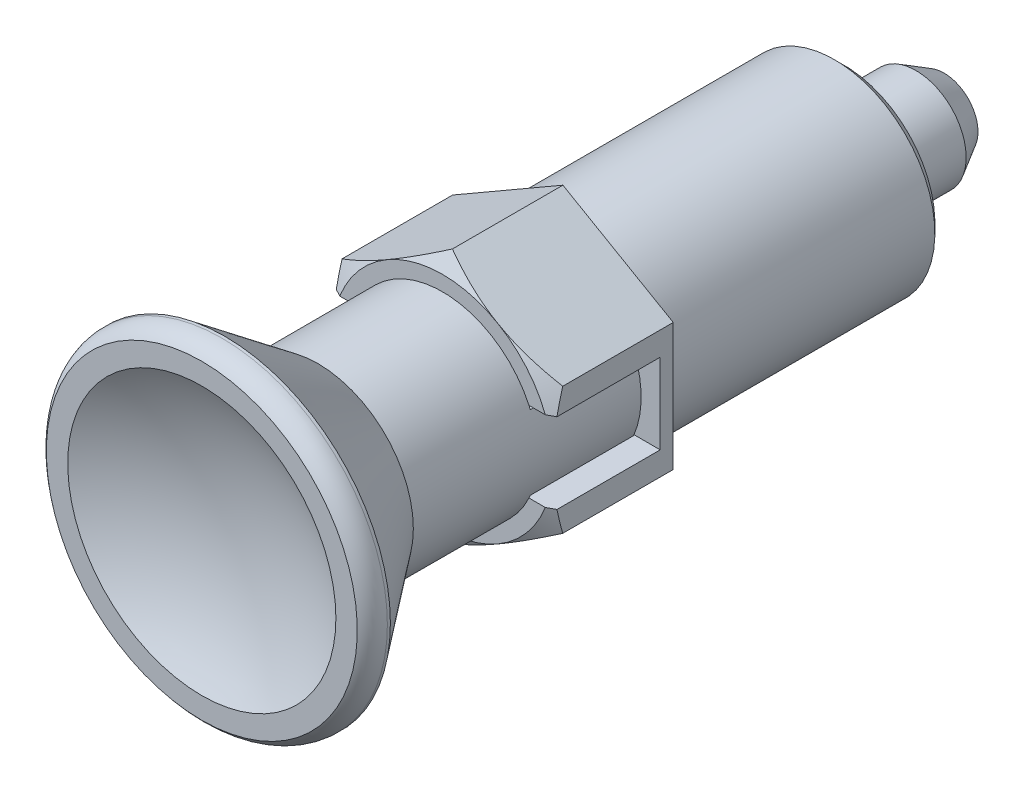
ISO-10303-21;
HEADER;
FILE_DESCRIPTION(('STEP AP214'),'2;1');
FILE_NAME('part.step','',(''),(''),'','','');
FILE_SCHEMA(('AUTOMOTIVE_DESIGN { 1 0 10303 214 1 1 1 1 }'));
ENDSEC;
DATA;
#1=APPLICATION_CONTEXT('core data for automotive mechanical design processes');
#2=APPLICATION_PROTOCOL_DEFINITION('international standard','automotive_design',2000,#1);
#3=PRODUCT_CONTEXT('',#1,'mechanical');
#4=PRODUCT('Part','Part','',(#3));
#5=PRODUCT_RELATED_PRODUCT_CATEGORY('part','',(#4));
#6=PRODUCT_DEFINITION_FORMATION('','',#4);
#7=PRODUCT_DEFINITION_CONTEXT('part definition',#1,'design');
#8=PRODUCT_DEFINITION('design','',#6,#7);
#9=PRODUCT_DEFINITION_SHAPE('','',#8);
#10=(LENGTH_UNIT() NAMED_UNIT(*) SI_UNIT(.MILLI.,.METRE.));
#11=(NAMED_UNIT(*) PLANE_ANGLE_UNIT() SI_UNIT($,.RADIAN.));
#12=(NAMED_UNIT(*) SI_UNIT($,.STERADIAN.) SOLID_ANGLE_UNIT());
#13=UNCERTAINTY_MEASURE_WITH_UNIT(LENGTH_MEASURE(1.E-05),#10,'distance_accuracy_value','');
#14=(GEOMETRIC_REPRESENTATION_CONTEXT(3) GLOBAL_UNCERTAINTY_ASSIGNED_CONTEXT((#13)) GLOBAL_UNIT_ASSIGNED_CONTEXT((#10,
#11,#12)) REPRESENTATION_CONTEXT('',''));
#15=CARTESIAN_POINT('',(0.,0.,0.));
#16=DIRECTION('',(0.,0.,1.));
#17=DIRECTION('',(1.,0.,0.));
#18=AXIS2_PLACEMENT_3D('',#15,#16,#17);
#19=CARTESIAN_POINT('',(11.,-6.3508529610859,0.));
#20=DIRECTION('',(1.,0.,0.));
#21=DIRECTION('',(0.,1.,0.));
#22=AXIS2_PLACEMENT_3D('',#19,#20,#21);
#23=PLANE('',#22);
#24=DIRECTION('',(0.,-1.,0.));
#25=VECTOR('',#24,1.);
#26=CARTESIAN_POINT('',(11.,0.,1.3));
#27=LINE('',#26,#25);
#28=CARTESIAN_POINT('',(11.,4.,1.3));
#29=VERTEX_POINT('',#28);
#30=CARTESIAN_POINT('',(11.,-4.,1.3));
#31=VERTEX_POINT('',#30);
#32=EDGE_CURVE('E527',#29,#31,#27,.T.);
#33=ORIENTED_EDGE('',*,*,#32,.T.);
#34=DIRECTION('',(0.,0.,1.));
#35=VECTOR('',#34,1.);
#36=CARTESIAN_POINT('',(11.,-4.,0.));
#37=LINE('',#36,#35);
#38=CARTESIAN_POINT('',(11.,-4.,11.5931413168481));
#39=VERTEX_POINT('',#38);
#40=EDGE_CURVE('E343',#31,#39,#37,.T.);
#41=ORIENTED_EDGE('',*,*,#40,.T.);
#42=CARTESIAN_POINT('',(11.,2.15952705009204,11.8787704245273));
#43=CARTESIAN_POINT('',(11.,1.89949471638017,11.907728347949));
#44=CARTESIAN_POINT('',(11.,1.63888752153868,11.9316497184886));
#45=CARTESIAN_POINT('',(11.,1.11691920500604,11.9690865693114));
#46=CARTESIAN_POINT('',(11.,0.855558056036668,11.9826016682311));
#47=CARTESIAN_POINT('',(11.,0.332851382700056,11.9988799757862));
#48=CARTESIAN_POINT('',(11.,0.0715063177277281,12.0016577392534));
#49=CARTESIAN_POINT('',(11.,-0.451066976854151,11.9964520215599));
#50=CARTESIAN_POINT('',(11.,-0.712295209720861,11.9884688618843));
#51=CARTESIAN_POINT('',(11.,-1.23033231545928,11.9621091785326));
#52=CARTESIAN_POINT('',(11.,-1.48714916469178,11.9438888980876));
#53=CARTESIAN_POINT('',(11.,-1.99989602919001,11.8975489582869));
#54=CARTESIAN_POINT('',(11.,-2.255825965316,11.8694284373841));
#55=CARTESIAN_POINT('',(11.,-3.02182990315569,11.7709851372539));
#56=CARTESIAN_POINT('',(11.,-3.53013683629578,11.6865795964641));
#57=CARTESIAN_POINT('',(11.,-4.53564567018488,11.4866768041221));
#58=CARTESIAN_POINT('',(11.,-5.0329063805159,11.371466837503));
#59=CARTESIAN_POINT('',(11.,-6.02087418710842,11.1153869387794));
#60=CARTESIAN_POINT('',(11.,-6.51157920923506,10.9745090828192));
#61=CARTESIAN_POINT('',(11.,-7.24665468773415,10.7466775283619));
#62=CARTESIAN_POINT('',(11.,-7.49342115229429,10.6673012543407));
#63=CARTESIAN_POINT('',(11.,-7.98540498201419,10.503853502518));
#64=CARTESIAN_POINT('',(11.,-8.23062230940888,10.4197819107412));
#65=CARTESIAN_POINT('',(11.,-8.71929186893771,10.2475901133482));
#66=CARTESIAN_POINT('',(11.,-8.96274587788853,10.1594749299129));
#67=CARTESIAN_POINT('',(11.,-9.44826664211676,9.97956834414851));
#68=CARTESIAN_POINT('',(11.,-9.69033352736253,9.88777729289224));
#69=CARTESIAN_POINT('',(11.,-9.93176925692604,9.79437314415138));
#70=B_SPLINE_CURVE_WITH_KNOTS('',3,(#42,#43,#44,#45,#46,#47,#48,#49,#50,#51,#52,#53,#54,#55,#56,
#57,#58,#59,#60,#61,#62,#63,#64,#65,#66,#67,#68,#69),.UNSPECIFIED.,.F.,.F.,(4,2,2,2,2,2,2,2,2,2,
2,2,2,4),(0.,0.784891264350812,1.56981129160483,2.35366695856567,3.13749920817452,
3.90968112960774,4.6819302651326,6.22637219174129,7.7568846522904,9.2878703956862,
10.0654909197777,10.8431303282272,11.6198287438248,12.3964531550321),.UNSPECIFIED.);
#71=CARTESIAN_POINT('',(11.,-6.3508529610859,11.0175196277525));
#72=VERTEX_POINT('',#71);
#73=EDGE_CURVE('E532',#39,#72,#70,.T.);
#74=ORIENTED_EDGE('',*,*,#73,.T.);
#75=DIRECTION('',(0.,0.,1.));
#76=VECTOR('',#75,1.);
#77=CARTESIAN_POINT('',(11.,-6.3508529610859,0.));
#78=LINE('',#77,#76);
#79=CARTESIAN_POINT('',(11.,-6.3508529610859,0.));
#80=VERTEX_POINT('',#79);
#81=EDGE_CURVE('E370',#80,#72,#78,.T.);
#82=ORIENTED_EDGE('',*,*,#81,.F.);
#83=DIRECTION('',(0.,1.,0.));
#84=VECTOR('',#83,1.);
#85=CARTESIAN_POINT('',(11.,-6.3508529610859,0.));
#86=LINE('',#85,#84);
#87=CARTESIAN_POINT('',(11.,6.3508529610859,0.));
#88=VERTEX_POINT('',#87);
#89=EDGE_CURVE('E348',#80,#88,#86,.T.);
#90=ORIENTED_EDGE('',*,*,#89,.T.);
#91=DIRECTION('',(0.,0.,1.));
#92=VECTOR('',#91,1.);
#93=CARTESIAN_POINT('',(11.,6.3508529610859,0.));
#94=LINE('',#93,#92);
#95=CARTESIAN_POINT('',(11.,6.3508529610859,11.0175196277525));
#96=VERTEX_POINT('',#95);
#97=EDGE_CURVE('E359',#88,#96,#94,.T.);
#98=ORIENTED_EDGE('',*,*,#97,.T.);
#99=CARTESIAN_POINT('',(11.,11.9080297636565,8.99134491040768));
#100=CARTESIAN_POINT('',(11.,11.6709072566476,9.09190051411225));
#101=CARTESIAN_POINT('',(11.,11.4332897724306,9.19129761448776));
#102=CARTESIAN_POINT('',(11.,10.9569597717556,9.38746451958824));
#103=CARTESIAN_POINT('',(11.,10.7182472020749,9.48423419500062));
#104=CARTESIAN_POINT('',(11.,10.2395290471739,9.67487228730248));
#105=CARTESIAN_POINT('',(11.,9.99952289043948,9.76873927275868));
#106=CARTESIAN_POINT('',(11.,9.51824044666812,9.95314445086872));
#107=CARTESIAN_POINT('',(11.,9.2769641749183,10.0436826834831));
#108=CARTESIAN_POINT('',(11.,8.55589635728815,10.3079255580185));
#109=CARTESIAN_POINT('',(11.,8.07408292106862,10.4761798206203));
#110=CARTESIAN_POINT('',(11.,7.10430736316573,10.7941345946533));
#111=CARTESIAN_POINT('',(11.,6.61634511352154,10.943834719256));
#112=CARTESIAN_POINT('',(11.,5.63008895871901,11.2208479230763));
#113=CARTESIAN_POINT('',(11.,5.13174505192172,11.3479849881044));
#114=CARTESIAN_POINT('',(11.,4.1285226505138,11.5726644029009));
#115=CARTESIAN_POINT('',(11.,3.62364754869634,11.6702215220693));
#116=CARTESIAN_POINT('',(11.,2.85973813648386,11.7904366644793));
#117=CARTESIAN_POINT('',(11.,2.60274396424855,11.8262637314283));
#118=CARTESIAN_POINT('',(11.,2.087591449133,11.88827870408));
#119=CARTESIAN_POINT('',(11.,1.82943315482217,11.9144670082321));
#120=CARTESIAN_POINT('',(11.,1.3117768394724,11.9567128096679));
#121=CARTESIAN_POINT('',(11.,1.05227718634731,11.9727504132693));
#122=CARTESIAN_POINT('',(11.,0.532793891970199,11.9943249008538));
#123=CARTESIAN_POINT('',(11.,0.27281016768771,11.9998597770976));
#124=CARTESIAN_POINT('',(11.,0.012811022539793,11.9999956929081));
#125=B_SPLINE_CURVE_WITH_KNOTS('',3,(#99,#100,#101,#102,#103,#104,#105,#106,#107,#108,#109,#110,
#111,#112,#113,#114,#115,#116,#117,#118,#119,#120,#121,#122,#123,#124),.UNSPECIFIED.,.F.,.F.,(4,
2,2,2,2,2,2,2,2,2,2,2,4),(0.,0.772689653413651,1.54541726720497,2.31852005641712,
3.09161356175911,4.62234314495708,6.15310463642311,7.69532761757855,9.23677928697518,
10.0150648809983,10.7933182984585,11.5730922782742,12.3530153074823),.UNSPECIFIED.);
#126=CARTESIAN_POINT('',(11.,4.,11.5931413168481));
#127=VERTEX_POINT('',#126);
#128=EDGE_CURVE('E1400',#96,#127,#125,.T.);
#129=ORIENTED_EDGE('',*,*,#128,.T.);
#130=DIRECTION('',(0.,0.,-1.));
#131=VECTOR('',#130,1.);
#132=CARTESIAN_POINT('',(11.,4.,0.));
#133=LINE('',#132,#131);
#134=EDGE_CURVE('E316',#127,#29,#133,.T.);
#135=ORIENTED_EDGE('',*,*,#134,.T.);
#136=EDGE_LOOP('',(#33,#41,#74,#82,#90,#98,#129,#135));
#137=FACE_BOUND('',#136,.T.);
#138=ADVANCED_FACE('F14',(#137),#23,.T.);
#139=CARTESIAN_POINT('',(11.,0.,12.));
#140=DIRECTION('',(0.,0.,-1.));
#141=DIRECTION('',(0.,1.,0.));
#142=AXIS2_PLACEMENT_3D('',#139,#140,#141);
#143=PLANE('',#142);
#144=CARTESIAN_POINT('',(0.,0.,12.));
#145=DIRECTION('',(0.,0.,-1.));
#146=DIRECTION('',(0.,1.,0.));
#147=AXIS2_PLACEMENT_3D('',#144,#145,#146);
#148=CIRCLE('',#147,9.5);
#149=CARTESIAN_POINT('',(-8.61684396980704,-4.,12.));
#150=VERTEX_POINT('',#149);
#151=CARTESIAN_POINT('',(8.61684396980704,-4.,12.));
#152=VERTEX_POINT('',#151);
#153=EDGE_CURVE('E479',#150,#152,#148,.F.);
#154=ORIENTED_EDGE('',*,*,#153,.F.);
#155=DIRECTION('',(1.,0.,0.));
#156=VECTOR('',#155,1.);
#157=CARTESIAN_POINT('',(-13.,-4.,12.));
#158=LINE('',#157,#156);
#159=CARTESIAN_POINT('',(-10.2469507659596,-4.,12.));
#160=VERTEX_POINT('',#159);
#161=EDGE_CURVE('E210',#160,#150,#158,.T.);
#162=ORIENTED_EDGE('',*,*,#161,.F.);
#163=CARTESIAN_POINT('',(0.,0.,12.));
#164=DIRECTION('',(0.,0.,1.));
#165=DIRECTION('',(0.,-1.,0.));
#166=AXIS2_PLACEMENT_3D('',#163,#164,#165);
#167=CIRCLE('',#166,11.);
#168=CARTESIAN_POINT('',(-5.50000000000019,-9.52627944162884,12.));
#169=VERTEX_POINT('',#168);
#170=EDGE_CURVE('E440',#160,#169,#167,.T.);
#171=ORIENTED_EDGE('',*,*,#170,.T.);
#172=CARTESIAN_POINT('',(5.50000000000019,-9.52627944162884,12.));
#173=VERTEX_POINT('',#172);
#174=EDGE_CURVE('E1404',#169,#173,#167,.T.);
#175=ORIENTED_EDGE('',*,*,#174,.T.);
#176=CARTESIAN_POINT('',(10.2469507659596,-4.,12.));
#177=VERTEX_POINT('',#176);
#178=EDGE_CURVE('E435',#173,#177,#167,.T.);
#179=ORIENTED_EDGE('',*,*,#178,.T.);
#180=DIRECTION('',(-1.,0.,0.));
#181=VECTOR('',#180,1.);
#182=CARTESIAN_POINT('',(13.,-4.,12.));
#183=LINE('',#182,#181);
#184=EDGE_CURVE('E308',#177,#152,#183,.T.);
#185=ORIENTED_EDGE('',*,*,#184,.T.);
#186=EDGE_LOOP('',(#154,#162,#171,#175,#179,#185));
#187=FACE_BOUND('',#186,.T.);
#188=ADVANCED_FACE('F517',(#187),#143,.F.);
#189=CARTESIAN_POINT('',(-5.50000000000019,9.52627944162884,12.));
#190=VERTEX_POINT('',#189);
#191=CARTESIAN_POINT('',(-10.2469507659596,4.,12.));
#192=VERTEX_POINT('',#191);
#193=EDGE_CURVE('E1403',#190,#192,#167,.T.);
#194=ORIENTED_EDGE('',*,*,#193,.T.);
#195=DIRECTION('',(1.,0.,0.));
#196=VECTOR('',#195,1.);
#197=CARTESIAN_POINT('',(-13.,4.,12.));
#198=LINE('',#197,#196);
#199=CARTESIAN_POINT('',(-8.61684396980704,4.,12.));
#200=VERTEX_POINT('',#199);
#201=EDGE_CURVE('E249',#192,#200,#198,.T.);
#202=ORIENTED_EDGE('',*,*,#201,.T.);
#203=CARTESIAN_POINT('',(8.61684396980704,4.,12.));
#204=VERTEX_POINT('',#203);
#205=EDGE_CURVE('E478',#204,#200,#148,.F.);
#206=ORIENTED_EDGE('',*,*,#205,.F.);
#207=DIRECTION('',(-1.,0.,0.));
#208=VECTOR('',#207,1.);
#209=CARTESIAN_POINT('',(13.,4.,12.));
#210=LINE('',#209,#208);
#211=CARTESIAN_POINT('',(10.2469507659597,4.,12.));
#212=VERTEX_POINT('',#211);
#213=EDGE_CURVE('E301',#212,#204,#210,.T.);
#214=ORIENTED_EDGE('',*,*,#213,.F.);
#215=CARTESIAN_POINT('',(5.50000000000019,9.52627944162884,12.));
#216=VERTEX_POINT('',#215);
#217=EDGE_CURVE('E436',#212,#216,#167,.T.);
#218=ORIENTED_EDGE('',*,*,#217,.T.);
#219=EDGE_CURVE('E439',#216,#190,#167,.T.);
#220=ORIENTED_EDGE('',*,*,#219,.T.);
#221=EDGE_LOOP('',(#194,#202,#206,#214,#218,#220));
#222=FACE_BOUND('',#221,.T.);
#223=ADVANCED_FACE('F523',(#222),#143,.F.);
#224=CARTESIAN_POINT('',(0.,0.,10.2679491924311));
#225=DIRECTION('',(0.,0.,-1.));
#226=DIRECTION('',(0.,1.,0.));
#227=AXIS2_PLACEMENT_3D('',#224,#225,#226);
#228=CONICAL_SURFACE('',#227,14.,1.0471975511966);
#229=CARTESIAN_POINT('',(18.3347636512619,4.,7.51628547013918));
#230=CARTESIAN_POINT('',(18.0142998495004,4.,7.69705180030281));
#231=CARTESIAN_POINT('',(17.6937455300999,4.,7.87765759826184));
#232=CARTESIAN_POINT('',(17.0524213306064,4.,8.23848613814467));
#233=CARTESIAN_POINT('',(16.7316514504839,4.,8.41870888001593));
#234=CARTESIAN_POINT('',(15.7690974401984,4.,8.95863618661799));
#235=CARTESIAN_POINT('',(15.1269385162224,4.,9.31767346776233));
#236=CARTESIAN_POINT('',(13.8418787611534,4.,10.032832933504));
#237=CARTESIAN_POINT('',(13.198979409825,4.,10.3889577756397));
#238=CARTESIAN_POINT('',(11.9109704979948,4.,11.0975191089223));
#239=CARTESIAN_POINT('',(11.2658605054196,4.,11.4499548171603));
#240=CARTESIAN_POINT('',(10.2951418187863,4.,11.974408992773));
#241=CARTESIAN_POINT('',(9.97075529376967,4.,12.1486881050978));
#242=CARTESIAN_POINT('',(9.32093000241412,4.,12.4952523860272));
#243=CARTESIAN_POINT('',(8.99549126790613,4.,12.6675376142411));
#244=CARTESIAN_POINT('',(8.34340178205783,4.,13.0093899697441));
#245=CARTESIAN_POINT('',(8.01675174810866,4.,13.1789584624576));
#246=CARTESIAN_POINT('',(7.36157696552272,4.,13.5145342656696));
#247=CARTESIAN_POINT('',(7.03305200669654,4.,13.6805411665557));
#248=CARTESIAN_POINT('',(6.3729039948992,4.,14.0078476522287));
#249=CARTESIAN_POINT('',(6.04127639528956,4.,14.1691381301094));
#250=CARTESIAN_POINT('',(5.54127191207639,4.,14.4055332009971));
#251=CARTESIAN_POINT('',(5.37420051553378,4.,14.4833974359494));
#252=CARTESIAN_POINT('',(5.03902090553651,4.,14.6368578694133));
#253=CARTESIAN_POINT('',(4.87091271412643,4.,14.7124541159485));
#254=CARTESIAN_POINT('',(4.53314616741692,4.,14.8609906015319));
#255=CARTESIAN_POINT('',(4.36348549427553,4.,14.9339255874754));
#256=CARTESIAN_POINT('',(4.02271404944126,4.,15.076284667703));
#257=CARTESIAN_POINT('',(3.85160343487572,4.,15.1457091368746));
#258=CARTESIAN_POINT('',(3.50746096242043,4.,15.2802278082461));
#259=CARTESIAN_POINT('',(3.33442722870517,4.,15.3453172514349));
#260=CARTESIAN_POINT('',(3.07334285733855,4.,15.4387642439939));
#261=CARTESIAN_POINT('',(2.98604258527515,4.,15.4692206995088));
#262=CARTESIAN_POINT('',(2.8108995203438,4.,15.5285527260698));
#263=CARTESIAN_POINT('',(2.72305668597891,4.,15.5574281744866));
#264=CARTESIAN_POINT('',(2.63492844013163,4.,15.585420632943));
#265=B_SPLINE_CURVE_WITH_KNOTS('',3,(#229,#230,#231,#232,#233,#234,#235,#236,#237,#238,#239,
#240,#241,#242,#243,#244,#245,#246,#247,#248,#249,#250,#251,#252,#253,#254,#255,#256,#257,#258,
#259,#260,#261,#262,#263,#264),.UNSPECIFIED.,.F.,.F.,(4,2,2,2,2,2,2,2,2,2,2,2,2,2,2,2,2,4),(0.,
1.10379404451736,2.20758824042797,4.41472730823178,6.61955650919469,8.82484450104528,
9.92955587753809,11.0342341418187,12.1383385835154,13.242569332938,14.3488076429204,
14.901769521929,15.4547196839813,16.008708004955,16.5626370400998,17.1171644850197,
17.3945322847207,17.671921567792),.UNSPECIFIED.);
#266=EDGE_CURVE('E309',#127,#212,#265,.T.);
#267=ORIENTED_EDGE('',*,*,#266,.F.);
#268=ORIENTED_EDGE('',*,*,#128,.F.);
#269=CARTESIAN_POINT('',(-0.000200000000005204,12.7018213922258,11.0174529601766));
#270=CARTESIAN_POINT('',(0.241603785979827,12.5622159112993,11.0980408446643));
#271=CARTESIAN_POINT('',(0.484309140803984,12.4220899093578,11.1749710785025));
#272=CARTESIAN_POINT('',(0.971666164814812,12.1407142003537,11.3205013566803));
#273=CARTESIAN_POINT('',(1.21631844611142,11.9994641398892,11.3890986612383));
#274=CARTESIAN_POINT('',(1.95421736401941,11.5734380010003,11.5810636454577));
#275=CARTESIAN_POINT('',(2.45037695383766,11.2869801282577,11.6902522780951));
#276=CARTESIAN_POINT('',(3.19285703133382,10.8583090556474,11.8182858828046));
#277=CARTESIAN_POINT('',(3.43695934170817,10.7173765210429,11.8547577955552));
#278=CARTESIAN_POINT('',(3.9262941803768,10.4348589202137,11.9159186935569));
#279=CARTESIAN_POINT('',(4.17152673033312,10.2932738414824,11.9406074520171));
#280=CARTESIAN_POINT('',(4.66240068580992,10.0098676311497,11.9775696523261));
#281=CARTESIAN_POINT('',(4.90804125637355,9.86804698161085,11.9898578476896));
#282=CARTESIAN_POINT('',(5.3995500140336,9.58427426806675,12.0017570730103));
#283=CARTESIAN_POINT('',(5.64541819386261,9.4423222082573,12.0013684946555));
#284=CARTESIAN_POINT('',(6.10507018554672,9.17694200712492,11.9887988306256));
#285=CARTESIAN_POINT('',(6.31888677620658,9.05349494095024,11.9781509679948));
#286=CARTESIAN_POINT('',(6.7460281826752,8.80688473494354,11.9474683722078));
#287=CARTESIAN_POINT('',(6.95935296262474,8.68372161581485,11.9274329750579));
#288=CARTESIAN_POINT('',(7.38539481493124,8.43774623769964,11.8783246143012));
#289=CARTESIAN_POINT('',(7.59811123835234,8.31493435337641,11.8492441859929));
#290=CARTESIAN_POINT('',(8.02254681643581,8.06988635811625,11.7825560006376));
#291=CARTESIAN_POINT('',(8.23426590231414,7.94765028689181,11.7449476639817));
#292=CARTESIAN_POINT('',(8.87695113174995,7.57659579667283,11.6183800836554));
#293=CARTESIAN_POINT('',(9.30605612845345,7.32885191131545,11.5168005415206));
#294=CARTESIAN_POINT('',(10.1578675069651,6.83705838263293,11.286256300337));
#295=CARTESIAN_POINT('',(10.580584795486,6.59300244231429,11.1573457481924));
#296=CARTESIAN_POINT('',(11.0002,6.35073749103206,11.0174529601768));
#297=B_SPLINE_CURVE_WITH_KNOTS('',3,(#269,#270,#271,#272,#273,#274,#275,#276,#277,#278,#279,
#280,#281,#282,#283,#284,#285,#286,#287,#288,#289,#290,#291,#292,#293,#294,#295,#296),
.UNSPECIFIED.,.F.,.F.,(4,2,2,2,2,2,2,2,2,2,2,2,2,4),(0.,0.871755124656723,1.74379610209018,
3.49159027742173,4.34403665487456,5.19649943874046,6.04794680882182,6.89936787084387,
7.64056020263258,8.38180496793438,9.12366309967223,9.86557166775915,11.3820155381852,
12.8954827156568),.UNSPECIFIED.);
#298=EDGE_CURVE('E477',#216,#96,#297,.T.);
#299=ORIENTED_EDGE('',*,*,#298,.F.);
#300=ORIENTED_EDGE('',*,*,#217,.F.);
#301=EDGE_LOOP('',(#267,#268,#299,#300));
#302=FACE_BOUND('',#301,.T.);
#303=ADVANCED_FACE('F618',(#302),#228,.T.);
#304=CARTESIAN_POINT('',(2.63492844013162,-4.,15.585420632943));
#305=CARTESIAN_POINT('',(2.73777606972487,-4.,15.5527509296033));
#306=CARTESIAN_POINT('',(2.84023427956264,-4.,15.5188817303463));
#307=CARTESIAN_POINT('',(3.04441663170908,-4.,15.449032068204));
#308=CARTESIAN_POINT('',(3.14614085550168,-4.,15.4130518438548));
#309=CARTESIAN_POINT('',(3.45021327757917,-4.,15.3024013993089));
#310=CARTESIAN_POINT('',(3.65156361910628,-4.,15.2249882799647));
#311=CARTESIAN_POINT('',(4.05176982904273,-4.,15.0647146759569));
#312=CARTESIAN_POINT('',(4.25062849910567,-4.,14.9818611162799));
#313=CARTESIAN_POINT('',(4.64654089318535,-4.,14.8118874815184));
#314=CARTESIAN_POINT('',(4.84359435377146,-4.,14.7247667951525));
#315=CARTESIAN_POINT('',(5.23582271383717,-4.,14.5473889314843));
#316=CARTESIAN_POINT('',(5.43100049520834,-4.,14.4571381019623));
#317=CARTESIAN_POINT('',(5.82012161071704,-4.,14.2740440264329));
#318=CARTESIAN_POINT('',(6.01406500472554,-4.,14.1812009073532));
#319=CARTESIAN_POINT('',(6.40101125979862,-4.,13.9934086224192));
#320=CARTESIAN_POINT('',(6.59401376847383,-4.,13.8984587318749));
#321=CARTESIAN_POINT('',(6.97918464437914,-4.,13.7068795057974));
#322=CARTESIAN_POINT('',(7.17135300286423,-4.,13.61025015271));
#323=CARTESIAN_POINT('',(7.63654965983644,-4.,13.3742469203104));
#324=CARTESIAN_POINT('',(7.90921944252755,-4.,13.2341667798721));
#325=CARTESIAN_POINT('',(8.45342249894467,-4.,12.9518991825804));
#326=CARTESIAN_POINT('',(8.7249559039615,-4.,12.8097119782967));
#327=CARTESIAN_POINT('',(9.2673244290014,-4.,12.5235852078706));
#328=CARTESIAN_POINT('',(9.53815897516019,-4.,12.3796445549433));
#329=CARTESIAN_POINT('',(10.0791300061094,-4.,12.0904353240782));
#330=CARTESIAN_POINT('',(10.3492664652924,-4.,11.9451666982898));
#331=CARTESIAN_POINT('',(11.266667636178,-4.,11.4495191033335));
#332=CARTESIAN_POINT('',(11.912580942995,-4.,11.096639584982));
#333=CARTESIAN_POINT('',(13.2023251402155,-4.,10.387110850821));
#334=CARTESIAN_POINT('',(13.8461560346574,-4.,10.030461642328));
#335=CARTESIAN_POINT('',(15.1313448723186,-4.,9.31521210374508));
#336=CARTESIAN_POINT('',(15.7727051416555,-4.,8.95661595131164));
#337=CARTESIAN_POINT('',(16.7339929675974,-4.,8.41739373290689));
#338=CARTESIAN_POINT('',(17.054294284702,-4.,8.2374330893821));
#339=CARTESIAN_POINT('',(17.6946817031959,-4.,7.87713014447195));
#340=CARTESIAN_POINT('',(18.0147678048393,-4.,7.69678784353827));
#341=CARTESIAN_POINT('',(18.3347636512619,-4.,7.51628547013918));
#342=B_SPLINE_CURVE_WITH_KNOTS('',3,(#304,#305,#306,#307,#308,#309,#310,#311,#312,#313,#314,
#315,#316,#317,#318,#319,#320,#321,#322,#323,#324,#325,#326,#327,#328,#329,#330,#331,#332,#333,
#334,#335,#336,#337,#338,#339,#340,#341),.UNSPECIFIED.,.F.,.F.,(4,2,2,2,2,2,2,2,2,2,2,2,2,2,2,2,
2,2,4),(0.,0.323715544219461,0.647394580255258,1.29443001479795,1.94065724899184,
2.58697732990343,3.23205562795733,3.87710239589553,4.52237459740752,5.16765354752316,
6.0872822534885,7.0068016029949,7.92692323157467,8.84707814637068,11.0551186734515,
13.2631549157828,15.4675568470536,16.5697403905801,17.6719226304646),.UNSPECIFIED.);
#343=EDGE_CURVE('E337',#177,#39,#342,.T.);
#344=ORIENTED_EDGE('',*,*,#343,.F.);
#345=ORIENTED_EDGE('',*,*,#178,.F.);
#346=CARTESIAN_POINT('',(11.0002,-6.35073749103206,11.0174529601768));
#347=CARTESIAN_POINT('',(10.7583962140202,-6.49034297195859,11.0980408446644));
#348=CARTESIAN_POINT('',(10.515690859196,-6.63046897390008,11.1749710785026));
#349=CARTESIAN_POINT('',(10.0283338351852,-6.91184468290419,11.3205013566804));
#350=CARTESIAN_POINT('',(9.78368155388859,-7.05309474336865,11.3890986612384));
#351=CARTESIAN_POINT('',(9.04578263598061,-7.47912088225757,11.5810636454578));
#352=CARTESIAN_POINT('',(8.54962304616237,-7.76557875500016,11.6902522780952));
#353=CARTESIAN_POINT('',(7.80714296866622,-8.19424982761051,11.8182858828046));
#354=CARTESIAN_POINT('',(7.56304065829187,-8.33518236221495,11.8547577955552));
#355=CARTESIAN_POINT('',(7.07370581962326,-8.61769996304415,11.9159186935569));
#356=CARTESIAN_POINT('',(6.82847326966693,-8.7592850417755,11.9406074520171));
#357=CARTESIAN_POINT('',(6.33759931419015,-9.0426912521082,11.9775696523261));
#358=CARTESIAN_POINT('',(6.09195874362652,-9.18451190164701,11.9898578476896));
#359=CARTESIAN_POINT('',(5.60044998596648,-9.46828461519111,12.0017570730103));
#360=CARTESIAN_POINT('',(5.35458180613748,-9.61023667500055,12.0013684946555));
#361=CARTESIAN_POINT('',(4.89492981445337,-9.87561687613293,11.9887988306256));
#362=CARTESIAN_POINT('',(4.6811132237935,-9.99906394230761,11.9781509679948));
#363=CARTESIAN_POINT('',(4.25397181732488,-10.2456741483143,11.9474683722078));
#364=CARTESIAN_POINT('',(4.04064703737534,-10.368837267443,11.9274329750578));
#365=CARTESIAN_POINT('',(3.61460518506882,-10.6148126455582,11.8783246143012));
#366=CARTESIAN_POINT('',(3.40188876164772,-10.7376245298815,11.8492441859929));
#367=CARTESIAN_POINT('',(2.97745318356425,-10.9826725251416,11.7825560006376));
#368=CARTESIAN_POINT('',(2.76573409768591,-11.1049085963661,11.7449476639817));
#369=CARTESIAN_POINT('',(2.12304886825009,-11.475963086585,11.6183800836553));
#370=CARTESIAN_POINT('',(1.69394387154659,-11.7237069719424,11.5168005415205));
#371=CARTESIAN_POINT('',(0.842132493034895,-12.215500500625,11.2862563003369));
#372=CARTESIAN_POINT('',(0.419415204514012,-12.4595564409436,11.1573457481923));
#373=CARTESIAN_POINT('',(-0.000199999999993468,-12.7018213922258,11.0174529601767));
#374=B_SPLINE_CURVE_WITH_KNOTS('',3,(#346,#347,#348,#349,#350,#351,#352,#353,#354,#355,#356,
#357,#358,#359,#360,#361,#362,#363,#364,#365,#366,#367,#368,#369,#370,#371,#372,#373),
.UNSPECIFIED.,.F.,.F.,(4,2,2,2,2,2,2,2,2,2,2,2,2,4),(0.,0.871755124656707,1.74379610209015,
3.49159027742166,4.34403665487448,5.19649943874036,6.04794680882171,6.89936787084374,
7.64056020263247,8.38180496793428,9.12366309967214,9.86557166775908,11.3820155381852,
12.8954827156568),.UNSPECIFIED.);
#375=EDGE_CURVE('E418',#72,#173,#374,.T.);
#376=ORIENTED_EDGE('',*,*,#375,.F.);
#377=ORIENTED_EDGE('',*,*,#73,.F.);
#378=EDGE_LOOP('',(#344,#345,#376,#377));
#379=FACE_BOUND('',#378,.T.);
#380=ADVANCED_FACE('F764',(#379),#228,.T.);
#381=CARTESIAN_POINT('',(0.,0.,-38.));
#382=DIRECTION('',(0.,0.,1.));
#383=DIRECTION('',(0.,-1.,0.));
#384=AXIS2_PLACEMENT_3D('',#381,#382,#383);
#385=CYLINDRICAL_SURFACE('',#384,9.5);
#386=CARTESIAN_POINT('',(0.,0.,1.7));
#387=DIRECTION('',(0.,0.,1.));
#388=DIRECTION('',(0.,-1.,0.));
#389=AXIS2_PLACEMENT_3D('',#386,#387,#388);
#390=CIRCLE('',#389,9.5);
#391=CARTESIAN_POINT('',(-8.7498571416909,-3.7,1.7));
#392=VERTEX_POINT('',#391);
#393=CARTESIAN_POINT('',(-8.7498571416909,3.7,1.7));
#394=VERTEX_POINT('',#393);
#395=EDGE_CURVE('E259',#392,#394,#390,.F.);
#396=ORIENTED_EDGE('',*,*,#395,.F.);
#397=DIRECTION('',(0.,0.,1.));
#398=VECTOR('',#397,1.);
#399=CARTESIAN_POINT('',(-8.7498571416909,-3.7,1.3));
#400=LINE('',#399,#398);
#401=CARTESIAN_POINT('',(-8.7498571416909,-3.7,12.));
#402=VERTEX_POINT('',#401);
#403=EDGE_CURVE('E427',#392,#402,#400,.T.);
#404=ORIENTED_EDGE('',*,*,#403,.T.);
#405=EDGE_CURVE('E480',#402,#150,#148,.F.);
#406=ORIENTED_EDGE('',*,*,#405,.T.);
#407=ORIENTED_EDGE('',*,*,#153,.T.);
#408=CARTESIAN_POINT('',(8.74985714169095,-3.7,12.));
#409=VERTEX_POINT('',#408);
#410=EDGE_CURVE('E473',#152,#409,#148,.F.);
#411=ORIENTED_EDGE('',*,*,#410,.T.);
#412=DIRECTION('',(0.,0.,1.));
#413=VECTOR('',#412,1.);
#414=CARTESIAN_POINT('',(8.7498571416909,-3.7,1.3));
#415=LINE('',#414,#413);
#416=CARTESIAN_POINT('',(8.7498571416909,-3.7,1.7));
#417=VERTEX_POINT('',#416);
#418=EDGE_CURVE('E430',#417,#409,#415,.T.);
#419=ORIENTED_EDGE('',*,*,#418,.F.);
#420=CARTESIAN_POINT('',(0.,0.,1.7));
#421=DIRECTION('',(0.,0.,-1.));
#422=DIRECTION('',(0.,1.,0.));
#423=AXIS2_PLACEMENT_3D('',#420,#421,#422);
#424=CIRCLE('',#423,9.5);
#425=CARTESIAN_POINT('',(8.74985714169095,3.7,1.7));
#426=VERTEX_POINT('',#425);
#427=EDGE_CURVE('E553',#417,#426,#424,.F.);
#428=ORIENTED_EDGE('',*,*,#427,.T.);
#429=DIRECTION('',(0.,0.,1.));
#430=VECTOR('',#429,1.);
#431=CARTESIAN_POINT('',(8.7498571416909,3.7,1.3));
#432=LINE('',#431,#430);
#433=CARTESIAN_POINT('',(8.74985714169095,3.7,12.));
#434=VERTEX_POINT('',#433);
#435=EDGE_CURVE('E432',#426,#434,#432,.T.);
#436=ORIENTED_EDGE('',*,*,#435,.T.);
#437=EDGE_CURVE('E474',#434,#204,#148,.F.);
#438=ORIENTED_EDGE('',*,*,#437,.T.);
#439=ORIENTED_EDGE('',*,*,#205,.T.);
#440=CARTESIAN_POINT('',(0.,0.,12.));
#441=DIRECTION('',(0.,0.,1.));
#442=DIRECTION('',(0.,-1.,0.));
#443=AXIS2_PLACEMENT_3D('',#440,#441,#442);
#444=CIRCLE('',#443,9.5);
#445=CARTESIAN_POINT('',(-8.7498571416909,3.7,12.));
#446=VERTEX_POINT('',#445);
#447=EDGE_CURVE('E254',#446,#200,#444,.F.);
#448=ORIENTED_EDGE('',*,*,#447,.F.);
#449=DIRECTION('',(0.,0.,1.));
#450=VECTOR('',#449,1.);
#451=CARTESIAN_POINT('',(-8.7498571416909,3.7,1.3));
#452=LINE('',#451,#450);
#453=EDGE_CURVE('E425',#394,#446,#452,.T.);
#454=ORIENTED_EDGE('',*,*,#453,.F.);
#455=EDGE_LOOP('',(#396,#404,#406,#407,#411,#419,#428,#436,#438,#439,#448,#454));
#456=FACE_BOUND('',#455,.T.);
#457=CARTESIAN_POINT('',(0.,0.,24.410686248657));
#458=DIRECTION('',(0.,0.,1.));
#459=DIRECTION('',(0.,-1.,0.));
#460=AXIS2_PLACEMENT_3D('',#457,#458,#459);
#461=CIRCLE('',#460,9.5);
#462=CARTESIAN_POINT('',(0.,-9.5,24.410686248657));
#463=VERTEX_POINT('',#462);
#464=EDGE_CURVE('E458',#463,#463,#461,.T.);
#465=ORIENTED_EDGE('',*,*,#464,.F.);
#466=EDGE_LOOP('',(#465));
#467=FACE_BOUND('',#466,.T.);
#468=ADVANCED_FACE('F557',(#456,#467),#385,.T.);
#469=CARTESIAN_POINT('',(10.,0.,0.));
#470=DIRECTION('',(0.,0.,1.));
#471=DIRECTION('',(0.,-1.,0.));
#472=AXIS2_PLACEMENT_3D('',#469,#470,#471);
#473=PLANE('',#472);
#474=CARTESIAN_POINT('',(0.,0.,0.));
#475=DIRECTION('',(0.,0.,1.));
#476=DIRECTION('',(0.,-1.,0.));
#477=AXIS2_PLACEMENT_3D('',#474,#475,#476);
#478=CIRCLE('',#477,10.);
#479=CARTESIAN_POINT('',(0.,-10.,0.));
#480=VERTEX_POINT('',#479);
#481=EDGE_CURVE('E438',#480,#480,#478,.T.);
#482=ORIENTED_EDGE('',*,*,#481,.T.);
#483=EDGE_LOOP('',(#482));
#484=FACE_BOUND('',#483,.T.);
#485=DIRECTION('',(-0.866025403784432,0.500000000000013,0.));
#486=VECTOR('',#485,1.);
#487=CARTESIAN_POINT('',(11.,6.3508529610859,0.));
#488=LINE('',#487,#486);
#489=CARTESIAN_POINT('',(0.,12.701705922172,0.));
#490=VERTEX_POINT('',#489);
#491=EDGE_CURVE('E346',#88,#490,#488,.T.);
#492=ORIENTED_EDGE('',*,*,#491,.F.);
#493=ORIENTED_EDGE('',*,*,#89,.F.);
#494=DIRECTION('',(0.866025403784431,0.500000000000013,0.));
#495=VECTOR('',#494,1.);
#496=CARTESIAN_POINT('',(0.,-12.701705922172,0.));
#497=LINE('',#496,#495);
#498=CARTESIAN_POINT('',(0.,-12.701705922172,0.));
#499=VERTEX_POINT('',#498);
#500=EDGE_CURVE('E350',#499,#80,#497,.T.);
#501=ORIENTED_EDGE('',*,*,#500,.F.);
#502=DIRECTION('',(0.866025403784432,-0.500000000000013,0.));
#503=VECTOR('',#502,1.);
#504=CARTESIAN_POINT('',(-11.,-6.3508529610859,0.));
#505=LINE('',#504,#503);
#506=CARTESIAN_POINT('',(-11.,-6.3508529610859,0.));
#507=VERTEX_POINT('',#506);
#508=EDGE_CURVE('E353',#507,#499,#505,.T.);
#509=ORIENTED_EDGE('',*,*,#508,.F.);
#510=DIRECTION('',(0.,-1.,0.));
#511=VECTOR('',#510,1.);
#512=CARTESIAN_POINT('',(-11.,6.3508529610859,0.));
#513=LINE('',#512,#511);
#514=CARTESIAN_POINT('',(-11.,6.3508529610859,0.));
#515=VERTEX_POINT('',#514);
#516=EDGE_CURVE('E355',#515,#507,#513,.T.);
#517=ORIENTED_EDGE('',*,*,#516,.F.);
#518=DIRECTION('',(-0.866025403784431,-0.500000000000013,0.));
#519=VECTOR('',#518,1.);
#520=CARTESIAN_POINT('',(0.,12.701705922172,0.));
#521=LINE('',#520,#519);
#522=EDGE_CURVE('E357',#490,#515,#521,.T.);
#523=ORIENTED_EDGE('',*,*,#522,.F.);
#524=EDGE_LOOP('',(#492,#493,#501,#509,#517,#523));
#525=FACE_BOUND('',#524,.T.);
#526=ADVANCED_FACE('F405',(#484,#525),#473,.F.);
#527=CARTESIAN_POINT('',(-11.,-6.3508529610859,0.));
#528=DIRECTION('',(-0.500000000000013,-0.866025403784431,0.));
#529=DIRECTION('',(0.866025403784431,-0.500000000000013,0.));
#530=AXIS2_PLACEMENT_3D('',#527,#528,#529);
#531=PLANE('',#530);
#532=CARTESIAN_POINT('',(0.000200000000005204,-12.7018213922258,11.0174529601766));
#533=CARTESIAN_POINT('',(-0.241603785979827,-12.5622159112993,11.0980408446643));
#534=CARTESIAN_POINT('',(-0.484309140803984,-12.4220899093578,11.1749710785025));
#535=CARTESIAN_POINT('',(-0.971666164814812,-12.1407142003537,11.3205013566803));
#536=CARTESIAN_POINT('',(-1.21631844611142,-11.9994641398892,11.3890986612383));
#537=CARTESIAN_POINT('',(-1.95421736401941,-11.5734380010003,11.5810636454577));
#538=CARTESIAN_POINT('',(-2.45037695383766,-11.2869801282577,11.6902522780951));
#539=CARTESIAN_POINT('',(-3.19285703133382,-10.8583090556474,11.8182858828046));
#540=CARTESIAN_POINT('',(-3.43695934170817,-10.7173765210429,11.8547577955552));
#541=CARTESIAN_POINT('',(-3.9262941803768,-10.4348589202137,11.9159186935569));
#542=CARTESIAN_POINT('',(-4.17152673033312,-10.2932738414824,11.9406074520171));
#543=CARTESIAN_POINT('',(-4.66240068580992,-10.0098676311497,11.9775696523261));
#544=CARTESIAN_POINT('',(-4.90804125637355,-9.86804698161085,11.9898578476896));
#545=CARTESIAN_POINT('',(-5.3995500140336,-9.58427426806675,12.0017570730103));
#546=CARTESIAN_POINT('',(-5.64541819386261,-9.4423222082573,12.0013684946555));
#547=CARTESIAN_POINT('',(-6.10507018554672,-9.17694200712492,11.9887988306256));
#548=CARTESIAN_POINT('',(-6.31888677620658,-9.05349494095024,11.9781509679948));
#549=CARTESIAN_POINT('',(-6.7460281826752,-8.80688473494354,11.9474683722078));
#550=CARTESIAN_POINT('',(-6.95935296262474,-8.68372161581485,11.9274329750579));
#551=CARTESIAN_POINT('',(-7.38539481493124,-8.43774623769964,11.8783246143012));
#552=CARTESIAN_POINT('',(-7.59811123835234,-8.31493435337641,11.8492441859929));
#553=CARTESIAN_POINT('',(-8.02254681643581,-8.06988635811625,11.7825560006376));
#554=CARTESIAN_POINT('',(-8.23426590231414,-7.94765028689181,11.7449476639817));
#555=CARTESIAN_POINT('',(-8.87695113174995,-7.57659579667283,11.6183800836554));
#556=CARTESIAN_POINT('',(-9.30605612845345,-7.32885191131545,11.5168005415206));
#557=CARTESIAN_POINT('',(-10.1578675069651,-6.83705838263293,11.286256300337));
#558=CARTESIAN_POINT('',(-10.580584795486,-6.59300244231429,11.1573457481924));
#559=CARTESIAN_POINT('',(-11.0002,-6.35073749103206,11.0174529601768));
#560=B_SPLINE_CURVE_WITH_KNOTS('',3,(#532,#533,#534,#535,#536,#537,#538,#539,#540,#541,#542,
#543,#544,#545,#546,#547,#548,#549,#550,#551,#552,#553,#554,#555,#556,#557,#558,#559),
.UNSPECIFIED.,.F.,.F.,(4,2,2,2,2,2,2,2,2,2,2,2,2,4),(0.,0.871755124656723,1.74379610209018,
3.49159027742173,4.34403665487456,5.19649943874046,6.04794680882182,6.89936787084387,
7.64056020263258,8.38180496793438,9.12366309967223,9.86557166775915,11.3820155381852,
12.8954827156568),.UNSPECIFIED.);
#561=CARTESIAN_POINT('',(0.,-12.701705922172,11.0175196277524));
#562=VERTEX_POINT('',#561);
#563=EDGE_CURVE('E417',#562,#169,#560,.T.);
#564=ORIENTED_EDGE('',*,*,#563,.T.);
#565=CARTESIAN_POINT('',(-11.,-6.3508529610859,11.0175196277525));
#566=VERTEX_POINT('',#565);
#567=EDGE_CURVE('E410',#169,#566,#560,.T.);
#568=ORIENTED_EDGE('',*,*,#567,.T.);
#569=DIRECTION('',(0.,0.,1.));
#570=VECTOR('',#569,1.);
#571=CARTESIAN_POINT('',(-11.,-6.3508529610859,0.));
#572=LINE('',#571,#570);
#573=EDGE_CURVE('E364',#507,#566,#572,.T.);
#574=ORIENTED_EDGE('',*,*,#573,.F.);
#575=ORIENTED_EDGE('',*,*,#508,.T.);
#576=DIRECTION('',(0.,0.,1.));
#577=VECTOR('',#576,1.);
#578=CARTESIAN_POINT('',(0.,-12.701705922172,0.));
#579=LINE('',#578,#577);
#580=EDGE_CURVE('E367',#499,#562,#579,.T.);
#581=ORIENTED_EDGE('',*,*,#580,.T.);
#582=EDGE_LOOP('',(#564,#568,#574,#575,#581));
#583=FACE_BOUND('',#582,.T.);
#584=ADVANCED_FACE('F399',(#583),#531,.T.);
#585=CARTESIAN_POINT('',(0.,-12.701705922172,0.));
#586=DIRECTION('',(0.500000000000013,-0.866025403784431,0.));
#587=DIRECTION('',(0.866025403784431,0.500000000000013,0.));
#588=AXIS2_PLACEMENT_3D('',#585,#586,#587);
#589=PLANE('',#588);
#590=ORIENTED_EDGE('',*,*,#375,.T.);
#591=EDGE_CURVE('E419',#173,#562,#374,.T.);
#592=ORIENTED_EDGE('',*,*,#591,.T.);
#593=ORIENTED_EDGE('',*,*,#580,.F.);
#594=ORIENTED_EDGE('',*,*,#500,.T.);
#595=ORIENTED_EDGE('',*,*,#81,.T.);
#596=EDGE_LOOP('',(#590,#592,#593,#594,#595));
#597=FACE_BOUND('',#596,.T.);
#598=ADVANCED_FACE('F404',(#597),#589,.T.);
#599=CARTESIAN_POINT('',(11.,6.3508529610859,0.));
#600=DIRECTION('',(0.500000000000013,0.866025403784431,0.));
#601=DIRECTION('',(-0.866025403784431,0.500000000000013,0.));
#602=AXIS2_PLACEMENT_3D('',#599,#600,#601);
#603=PLANE('',#602);
#604=CARTESIAN_POINT('',(0.,12.701705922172,11.0175196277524));
#605=VERTEX_POINT('',#604);
#606=EDGE_CURVE('E487',#605,#216,#297,.T.);
#607=ORIENTED_EDGE('',*,*,#606,.T.);
#608=ORIENTED_EDGE('',*,*,#298,.T.);
#609=ORIENTED_EDGE('',*,*,#97,.F.);
#610=ORIENTED_EDGE('',*,*,#491,.T.);
#611=DIRECTION('',(0.,0.,1.));
#612=VECTOR('',#611,1.);
#613=CARTESIAN_POINT('',(0.,12.701705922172,0.));
#614=LINE('',#613,#612);
#615=EDGE_CURVE('E363',#490,#605,#614,.T.);
#616=ORIENTED_EDGE('',*,*,#615,.T.);
#617=EDGE_LOOP('',(#607,#608,#609,#610,#616));
#618=FACE_BOUND('',#617,.T.);
#619=ADVANCED_FACE('F494',(#618),#603,.T.);
#620=CARTESIAN_POINT('',(0.,12.701705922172,0.));
#621=DIRECTION('',(-0.500000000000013,0.866025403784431,0.));
#622=DIRECTION('',(-0.866025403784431,-0.500000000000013,0.));
#623=AXIS2_PLACEMENT_3D('',#620,#621,#622);
#624=PLANE('',#623);
#625=CARTESIAN_POINT('',(-11.0002,6.35073749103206,11.0174529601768));
#626=CARTESIAN_POINT('',(-10.7583962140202,6.49034297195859,11.0980408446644));
#627=CARTESIAN_POINT('',(-10.515690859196,6.63046897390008,11.1749710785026));
#628=CARTESIAN_POINT('',(-10.0283338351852,6.91184468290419,11.3205013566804));
#629=CARTESIAN_POINT('',(-9.78368155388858,7.05309474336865,11.3890986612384));
#630=CARTESIAN_POINT('',(-9.04578263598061,7.47912088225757,11.5810636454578));
#631=CARTESIAN_POINT('',(-8.54962304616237,7.76557875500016,11.6902522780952));
#632=CARTESIAN_POINT('',(-7.80714296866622,8.19424982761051,11.8182858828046));
#633=CARTESIAN_POINT('',(-7.56304065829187,8.33518236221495,11.8547577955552));
#634=CARTESIAN_POINT('',(-7.07370581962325,8.61769996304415,11.9159186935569));
#635=CARTESIAN_POINT('',(-6.82847326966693,8.7592850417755,11.9406074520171));
#636=CARTESIAN_POINT('',(-6.33759931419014,9.04269125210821,11.9775696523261));
#637=CARTESIAN_POINT('',(-6.09195874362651,9.18451190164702,11.9898578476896));
#638=CARTESIAN_POINT('',(-5.60044998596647,9.46828461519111,12.0017570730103));
#639=CARTESIAN_POINT('',(-5.35458180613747,9.61023667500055,12.0013684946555));
#640=CARTESIAN_POINT('',(-4.89492981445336,9.87561687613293,11.9887988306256));
#641=CARTESIAN_POINT('',(-4.6811132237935,9.99906394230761,11.9781509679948));
#642=CARTESIAN_POINT('',(-4.25397181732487,10.2456741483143,11.9474683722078));
#643=CARTESIAN_POINT('',(-4.04064703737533,10.368837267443,11.9274329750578));
#644=CARTESIAN_POINT('',(-3.61460518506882,10.6148126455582,11.8783246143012));
#645=CARTESIAN_POINT('',(-3.40188876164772,10.7376245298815,11.8492441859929));
#646=CARTESIAN_POINT('',(-2.97745318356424,10.9826725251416,11.7825560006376));
#647=CARTESIAN_POINT('',(-2.76573409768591,11.1049085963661,11.7449476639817));
#648=CARTESIAN_POINT('',(-2.12304886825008,11.475963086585,11.6183800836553));
#649=CARTESIAN_POINT('',(-1.69394387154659,11.7237069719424,11.5168005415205));
#650=CARTESIAN_POINT('',(-0.842132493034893,12.215500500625,11.2862563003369));
#651=CARTESIAN_POINT('',(-0.419415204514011,12.4595564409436,11.1573457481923));
#652=CARTESIAN_POINT('',(0.000199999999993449,12.7018213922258,11.0174529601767));
#653=B_SPLINE_CURVE_WITH_KNOTS('',3,(#625,#626,#627,#628,#629,#630,#631,#632,#633,#634,#635,
#636,#637,#638,#639,#640,#641,#642,#643,#644,#645,#646,#647,#648,#649,#650,#651,#652),
.UNSPECIFIED.,.F.,.F.,(4,2,2,2,2,2,2,2,2,2,2,2,2,4),(0.,0.871755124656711,1.74379610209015,
3.49159027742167,4.34403665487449,5.19649943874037,6.04794680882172,6.89936787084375,
7.64056020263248,8.38180496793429,9.12366309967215,9.86557166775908,11.3820155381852,
12.8954827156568),.UNSPECIFIED.);
#654=CARTESIAN_POINT('',(-11.,6.3508529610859,11.0175196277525));
#655=VERTEX_POINT('',#654);
#656=EDGE_CURVE('E560',#655,#190,#653,.T.);
#657=ORIENTED_EDGE('',*,*,#656,.T.);
#658=EDGE_CURVE('E488',#190,#605,#653,.T.);
#659=ORIENTED_EDGE('',*,*,#658,.T.);
#660=ORIENTED_EDGE('',*,*,#615,.F.);
#661=ORIENTED_EDGE('',*,*,#522,.T.);
#662=DIRECTION('',(0.,0.,1.));
#663=VECTOR('',#662,1.);
#664=CARTESIAN_POINT('',(-11.,6.3508529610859,0.));
#665=LINE('',#664,#663);
#666=EDGE_CURVE('E360',#515,#655,#665,.T.);
#667=ORIENTED_EDGE('',*,*,#666,.T.);
#668=EDGE_LOOP('',(#657,#659,#660,#661,#667));
#669=FACE_BOUND('',#668,.T.);
#670=ADVANCED_FACE('F396',(#669),#624,.T.);
#671=CARTESIAN_POINT('',(-11.,6.3508529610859,0.));
#672=DIRECTION('',(-1.,0.,0.));
#673=DIRECTION('',(0.,-1.,0.));
#674=AXIS2_PLACEMENT_3D('',#671,#672,#673);
#675=PLANE('',#674);
#676=DIRECTION('',(0.,0.,1.));
#677=VECTOR('',#676,1.);
#678=CARTESIAN_POINT('',(-11.,-4.,0.));
#679=LINE('',#678,#677);
#680=CARTESIAN_POINT('',(-11.,-4.,1.3));
#681=VERTEX_POINT('',#680);
#682=CARTESIAN_POINT('',(-11.,-4.,11.5931413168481));
#683=VERTEX_POINT('',#682);
#684=EDGE_CURVE('E35',#681,#683,#679,.T.);
#685=ORIENTED_EDGE('',*,*,#684,.F.);
#686=DIRECTION('',(0.,1.,0.));
#687=VECTOR('',#686,1.);
#688=CARTESIAN_POINT('',(-11.,0.,1.3));
#689=LINE('',#688,#687);
#690=CARTESIAN_POINT('',(-11.,4.,1.3));
#691=VERTEX_POINT('',#690);
#692=EDGE_CURVE('E375',#681,#691,#689,.T.);
#693=ORIENTED_EDGE('',*,*,#692,.T.);
#694=DIRECTION('',(0.,0.,-1.));
#695=VECTOR('',#694,1.);
#696=CARTESIAN_POINT('',(-11.,4.,0.));
#697=LINE('',#696,#695);
#698=CARTESIAN_POINT('',(-10.9999999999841,4.,11.5931413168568));
#699=VERTEX_POINT('',#698);
#700=EDGE_CURVE('E256',#699,#691,#697,.T.);
#701=ORIENTED_EDGE('',*,*,#700,.F.);
#702=CARTESIAN_POINT('',(-11.,0.0128110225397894,11.9999956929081));
#703=CARTESIAN_POINT('',(-11.,0.272810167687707,11.9998597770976));
#704=CARTESIAN_POINT('',(-11.,0.532793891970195,11.9943249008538));
#705=CARTESIAN_POINT('',(-11.,1.0522771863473,11.9727504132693));
#706=CARTESIAN_POINT('',(-11.,1.31177683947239,11.9567128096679));
#707=CARTESIAN_POINT('',(-11.,1.82943315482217,11.9144670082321));
#708=CARTESIAN_POINT('',(-11.,2.08759144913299,11.88827870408));
#709=CARTESIAN_POINT('',(-11.,2.60274396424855,11.8262637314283));
#710=CARTESIAN_POINT('',(-11.,2.85973813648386,11.7904366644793));
#711=CARTESIAN_POINT('',(-11.,3.62364754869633,11.6702215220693));
#712=CARTESIAN_POINT('',(-11.,4.1285226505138,11.5726644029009));
#713=CARTESIAN_POINT('',(-11.,5.13174505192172,11.3479849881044));
#714=CARTESIAN_POINT('',(-11.,5.63008895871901,11.2208479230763));
#715=CARTESIAN_POINT('',(-11.,6.61634511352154,10.943834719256));
#716=CARTESIAN_POINT('',(-11.,7.10430736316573,10.7941345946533));
#717=CARTESIAN_POINT('',(-11.,8.07408292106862,10.4761798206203));
#718=CARTESIAN_POINT('',(-11.,8.55589635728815,10.3079255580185));
#719=CARTESIAN_POINT('',(-11.,9.2769641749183,10.0436826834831));
#720=CARTESIAN_POINT('',(-11.,9.51824044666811,9.95314445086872));
#721=CARTESIAN_POINT('',(-11.,9.99952289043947,9.76873927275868));
#722=CARTESIAN_POINT('',(-11.,10.2395290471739,9.67487228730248));
#723=CARTESIAN_POINT('',(-11.,10.7182472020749,9.48423419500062));
#724=CARTESIAN_POINT('',(-11.,10.9569597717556,9.38746451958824));
#725=CARTESIAN_POINT('',(-11.,11.4332897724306,9.19129761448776));
#726=CARTESIAN_POINT('',(-11.,11.6709072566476,9.09190051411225));
#727=CARTESIAN_POINT('',(-11.,11.9080297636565,8.99134491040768));
#728=B_SPLINE_CURVE_WITH_KNOTS('',3,(#702,#703,#704,#705,#706,#707,#708,#709,#710,#711,#712,
#713,#714,#715,#716,#717,#718,#719,#720,#721,#722,#723,#724,#725,#726,#727),.UNSPECIFIED.,.F.,
.F.,(4,2,2,2,2,2,2,2,2,2,2,2,4),(0.,0.779923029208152,1.55969700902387,2.33795042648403,
3.11623602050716,4.65768768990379,6.19991067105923,7.73067216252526,9.26140174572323,
10.0344952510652,10.8075980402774,11.5803256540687,12.3530153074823),.UNSPECIFIED.);
#729=EDGE_CURVE('E379',#699,#655,#728,.T.);
#730=ORIENTED_EDGE('',*,*,#729,.T.);
#731=ORIENTED_EDGE('',*,*,#666,.F.);
#732=ORIENTED_EDGE('',*,*,#516,.T.);
#733=ORIENTED_EDGE('',*,*,#573,.T.);
#734=CARTESIAN_POINT('',(-11.,-9.93176925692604,9.79437314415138));
#735=CARTESIAN_POINT('',(-11.,-9.69033352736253,9.88777729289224));
#736=CARTESIAN_POINT('',(-11.,-9.44826664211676,9.97956834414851));
#737=CARTESIAN_POINT('',(-11.,-8.96274587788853,10.1594749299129));
#738=CARTESIAN_POINT('',(-11.,-8.71929186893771,10.2475901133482));
#739=CARTESIAN_POINT('',(-11.,-8.23062230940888,10.4197819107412));
#740=CARTESIAN_POINT('',(-11.,-7.9854049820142,10.503853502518));
#741=CARTESIAN_POINT('',(-11.,-7.49342115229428,10.6673012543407));
#742=CARTESIAN_POINT('',(-11.,-7.24665468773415,10.7466775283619));
#743=CARTESIAN_POINT('',(-11.,-6.51157920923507,10.9745090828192));
#744=CARTESIAN_POINT('',(-11.,-6.02087418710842,11.1153869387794));
#745=CARTESIAN_POINT('',(-11.,-5.0329063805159,11.371466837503));
#746=CARTESIAN_POINT('',(-11.,-4.53564567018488,11.4866768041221));
#747=CARTESIAN_POINT('',(-11.,-3.53013683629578,11.6865795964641));
#748=CARTESIAN_POINT('',(-11.,-3.02182990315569,11.7709851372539));
#749=CARTESIAN_POINT('',(-11.,-2.255825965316,11.8694284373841));
#750=CARTESIAN_POINT('',(-11.,-1.99989602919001,11.8975489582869));
#751=CARTESIAN_POINT('',(-11.,-1.48714916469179,11.9438888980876));
#752=CARTESIAN_POINT('',(-11.,-1.23033231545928,11.9621091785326));
#753=CARTESIAN_POINT('',(-11.,-0.712295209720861,11.9884688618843));
#754=CARTESIAN_POINT('',(-11.,-0.451066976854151,11.9964520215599));
#755=CARTESIAN_POINT('',(-11.,0.0715063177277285,12.0016577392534));
#756=CARTESIAN_POINT('',(-11.,0.332851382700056,11.9988799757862));
#757=CARTESIAN_POINT('',(-11.,0.855558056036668,11.9826016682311));
#758=CARTESIAN_POINT('',(-11.,1.11691920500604,11.9690865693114));
#759=CARTESIAN_POINT('',(-11.,1.63888752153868,11.9316497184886));
#760=CARTESIAN_POINT('',(-11.,1.89949471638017,11.907728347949));
#761=CARTESIAN_POINT('',(-11.,2.15952705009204,11.8787704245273));
#762=B_SPLINE_CURVE_WITH_KNOTS('',3,(#734,#735,#736,#737,#738,#739,#740,#741,#742,#743,#744,
#745,#746,#747,#748,#749,#750,#751,#752,#753,#754,#755,#756,#757,#758,#759,#760,#761),
.UNSPECIFIED.,.F.,.F.,(4,2,2,2,2,2,2,2,2,2,2,2,2,4),(0.,0.776624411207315,1.55332282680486,
2.33096223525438,3.1085827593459,4.6395685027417,6.17008096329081,7.7145228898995,
8.48677202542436,9.25895394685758,10.0427861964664,10.8266418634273,11.6115618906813,
12.3964531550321),.UNSPECIFIED.);
#763=EDGE_CURVE('E386',#566,#683,#762,.T.);
#764=ORIENTED_EDGE('',*,*,#763,.T.);
#765=EDGE_LOOP('',(#685,#693,#701,#730,#731,#732,#733,#764));
#766=FACE_BOUND('',#765,.T.);
#767=ADVANCED_FACE('F392',(#766),#675,.T.);
#768=CARTESIAN_POINT('',(-2.8275992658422E-12,0.,58.3000000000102));
#769=DIRECTION('',(0.,0.,1.));
#770=DIRECTION('',(1.,0.,0.));
#771=AXIS2_PLACEMENT_3D('',#768,#769,#770);
#772=SPHERICAL_SURFACE('',#771,26.0000000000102);
#773=CARTESIAN_POINT('',(0.,0.,36.));
#774=DIRECTION('',(0.,0.,1.));
#775=DIRECTION('',(0.,-1.,0.));
#776=AXIS2_PLACEMENT_3D('',#773,#774,#775);
#777=CIRCLE('',#776,13.36824595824);
#778=CARTESIAN_POINT('',(0.,-13.36824595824,36.));
#779=VERTEX_POINT('',#778);
#780=EDGE_CURVE('E470',#779,#779,#777,.T.);
#781=ORIENTED_EDGE('',*,*,#780,.T.);
#782=EDGE_LOOP('',(#781));
#783=FACE_BOUND('',#782,.T.);
#784=ADVANCED_FACE('F16',(#783),#772,.F.);
#785=CARTESIAN_POINT('',(13.36824595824,0.,36.));
#786=DIRECTION('',(0.,0.,1.));
#787=DIRECTION('',(0.,-1.,0.));
#788=AXIS2_PLACEMENT_3D('',#785,#786,#787);
#789=PLANE('',#788);
#790=CARTESIAN_POINT('',(0.,0.,36.));
#791=DIRECTION('',(0.,0.,1.));
#792=DIRECTION('',(0.,-1.,0.));
#793=AXIS2_PLACEMENT_3D('',#790,#791,#792);
#794=CIRCLE('',#793,15.5);
#795=CARTESIAN_POINT('',(0.,-15.5,36.));
#796=VERTEX_POINT('',#795);
#797=EDGE_CURVE('E467',#796,#796,#794,.T.);
#798=ORIENTED_EDGE('',*,*,#797,.T.);
#799=EDGE_LOOP('',(#798));
#800=FACE_BOUND('',#799,.T.);
#801=ORIENTED_EDGE('',*,*,#780,.F.);
#802=EDGE_LOOP('',(#801));
#803=FACE_BOUND('',#802,.T.);
#804=ADVANCED_FACE('F797',(#800,#803),#789,.T.);
#805=CARTESIAN_POINT('',(0.,0.,34.000000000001));
#806=DIRECTION('',(0.,0.,1.));
#807=DIRECTION('',(0.,-1.,0.));
#808=AXIS2_PLACEMENT_3D('',#805,#806,#807);
#809=TOROIDAL_SURFACE('',#808,14.000000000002,2.499999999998);
#810=CARTESIAN_POINT('',(0.,0.,34.));
#811=DIRECTION('',(0.,0.,1.));
#812=DIRECTION('',(0.,-1.,0.));
#813=AXIS2_PLACEMENT_3D('',#810,#811,#812);
#814=CIRCLE('',#813,16.5);
#815=CARTESIAN_POINT('',(0.,-16.5,34.));
#816=VERTEX_POINT('',#815);
#817=EDGE_CURVE('E464',#816,#816,#814,.T.);
#818=ORIENTED_EDGE('',*,*,#817,.T.);
#819=EDGE_LOOP('',(#818));
#820=FACE_BOUND('',#819,.T.);
#821=ORIENTED_EDGE('',*,*,#797,.F.);
#822=EDGE_LOOP('',(#821));
#823=FACE_BOUND('',#822,.T.);
#824=ADVANCED_FACE('F785',(#820,#823),#809,.T.);
#825=CARTESIAN_POINT('',(0.,0.,-38.));
#826=DIRECTION('',(0.,0.,1.));
#827=DIRECTION('',(0.,-1.,0.));
#828=AXIS2_PLACEMENT_3D('',#825,#826,#827);
#829=CYLINDRICAL_SURFACE('',#828,16.5);
#830=CARTESIAN_POINT('',(0.,0.,33.7));
#831=DIRECTION('',(0.,0.,1.));
#832=DIRECTION('',(0.,-1.,0.));
#833=AXIS2_PLACEMENT_3D('',#830,#831,#832);
#834=CIRCLE('',#833,16.5);
#835=CARTESIAN_POINT('',(0.,-16.5,33.7));
#836=VERTEX_POINT('',#835);
#837=EDGE_CURVE('E461',#836,#836,#834,.T.);
#838=ORIENTED_EDGE('',*,*,#837,.T.);
#839=EDGE_LOOP('',(#838));
#840=FACE_BOUND('',#839,.T.);
#841=ORIENTED_EDGE('',*,*,#817,.F.);
#842=EDGE_LOOP('',(#841));
#843=FACE_BOUND('',#842,.T.);
#844=ADVANCED_FACE('F773',(#840,#843),#829,.T.);
#845=CARTESIAN_POINT('',(0.,0.,33.7));
#846=DIRECTION('',(0.,0.,1.));
#847=DIRECTION('',(0.,-1.,0.));
#848=AXIS2_PLACEMENT_3D('',#845,#846,#847);
#849=CONICAL_SURFACE('',#848,16.5,0.645771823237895);
#850=ORIENTED_EDGE('',*,*,#464,.T.);
#851=EDGE_LOOP('',(#850));
#852=FACE_BOUND('',#851,.T.);
#853=ORIENTED_EDGE('',*,*,#837,.F.);
#854=EDGE_LOOP('',(#853));
#855=FACE_BOUND('',#854,.T.);
#856=ADVANCED_FACE('F762',(#852,#855),#849,.T.);
#857=ORIENTED_EDGE('',*,*,#563,.F.);
#858=ORIENTED_EDGE('',*,*,#591,.F.);
#859=ORIENTED_EDGE('',*,*,#174,.F.);
#860=EDGE_LOOP('',(#857,#858,#859));
#861=FACE_BOUND('',#860,.T.);
#862=ADVANCED_FACE('F513',(#861),#228,.T.);
#863=ORIENTED_EDGE('',*,*,#658,.F.);
#864=ORIENTED_EDGE('',*,*,#219,.F.);
#865=ORIENTED_EDGE('',*,*,#606,.F.);
#866=EDGE_LOOP('',(#863,#864,#865));
#867=FACE_BOUND('',#866,.T.);
#868=ADVANCED_FACE('F506',(#867),#228,.T.);
#869=CARTESIAN_POINT('',(4.96130914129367E-13,0.,1.3));
#870=DIRECTION('',(0.,0.,-1.));
#871=DIRECTION('',(0.,1.,0.));
#872=AXIS2_PLACEMENT_3D('',#869,#870,#871);
#873=PLANE('',#872);
#874=DIRECTION('',(-1.,0.,0.));
#875=VECTOR('',#874,1.);
#876=CARTESIAN_POINT('',(13.,-4.,1.3));
#877=LINE('',#876,#875);
#878=CARTESIAN_POINT('',(6.95,-4.,1.3));
#879=VERTEX_POINT('',#878);
#880=EDGE_CURVE('E304',#31,#879,#877,.T.);
#881=ORIENTED_EDGE('',*,*,#880,.F.);
#882=ORIENTED_EDGE('',*,*,#32,.F.);
#883=DIRECTION('',(-1.,0.,0.));
#884=VECTOR('',#883,1.);
#885=CARTESIAN_POINT('',(13.,4.,1.3));
#886=LINE('',#885,#884);
#887=CARTESIAN_POINT('',(6.95,4.,1.3));
#888=VERTEX_POINT('',#887);
#889=EDGE_CURVE('E302',#29,#888,#886,.T.);
#890=ORIENTED_EDGE('',*,*,#889,.T.);
#891=DIRECTION('',(0.,1.,0.));
#892=VECTOR('',#891,1.);
#893=CARTESIAN_POINT('',(6.95,-4.,1.3));
#894=LINE('',#893,#892);
#895=EDGE_CURVE('E266',#879,#888,#894,.T.);
#896=ORIENTED_EDGE('',*,*,#895,.F.);
#897=EDGE_LOOP('',(#881,#882,#890,#896));
#898=FACE_BOUND('',#897,.T.);
#899=ADVANCED_FACE('F503',(#898),#873,.F.);
#900=CARTESIAN_POINT('',(-4.97865637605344E-13,0.,1.3));
#901=DIRECTION('',(0.,0.,-1.));
#902=DIRECTION('',(0.,1.,0.));
#903=AXIS2_PLACEMENT_3D('',#900,#901,#902);
#904=PLANE('',#903);
#905=DIRECTION('',(1.,0.,0.));
#906=VECTOR('',#905,1.);
#907=CARTESIAN_POINT('',(-13.,4.,1.3));
#908=LINE('',#907,#906);
#909=CARTESIAN_POINT('',(-6.95,4.,1.3));
#910=VERTEX_POINT('',#909);
#911=EDGE_CURVE('E250',#691,#910,#908,.T.);
#912=ORIENTED_EDGE('',*,*,#911,.F.);
#913=ORIENTED_EDGE('',*,*,#692,.F.);
#914=DIRECTION('',(1.,0.,0.));
#915=VECTOR('',#914,1.);
#916=CARTESIAN_POINT('',(-13.,-4.,1.3));
#917=LINE('',#916,#915);
#918=CARTESIAN_POINT('',(-6.95,-4.,1.3));
#919=VERTEX_POINT('',#918);
#920=EDGE_CURVE('E214',#681,#919,#917,.T.);
#921=ORIENTED_EDGE('',*,*,#920,.T.);
#922=DIRECTION('',(0.,1.,0.));
#923=VECTOR('',#922,1.);
#924=CARTESIAN_POINT('',(-6.95,-4.,1.3));
#925=LINE('',#924,#923);
#926=EDGE_CURVE('E224',#919,#910,#925,.T.);
#927=ORIENTED_EDGE('',*,*,#926,.T.);
#928=EDGE_LOOP('',(#912,#913,#921,#927));
#929=FACE_BOUND('',#928,.T.);
#930=ADVANCED_FACE('F500',(#929),#904,.F.);
#931=ORIENTED_EDGE('',*,*,#729,.F.);
#932=CARTESIAN_POINT('',(-18.3347636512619,4.,7.51628547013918));
#933=CARTESIAN_POINT('',(-18.0142998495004,4.,7.69705180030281));
#934=CARTESIAN_POINT('',(-17.6937455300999,4.,7.87765759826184));
#935=CARTESIAN_POINT('',(-17.0524213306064,4.,8.23848613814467));
#936=CARTESIAN_POINT('',(-16.7316514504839,4.,8.41870888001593));
#937=CARTESIAN_POINT('',(-15.7690974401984,4.,8.95863618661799));
#938=CARTESIAN_POINT('',(-15.1269385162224,4.,9.31767346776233));
#939=CARTESIAN_POINT('',(-13.8418787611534,4.,10.032832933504));
#940=CARTESIAN_POINT('',(-13.198979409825,4.,10.3889577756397));
#941=CARTESIAN_POINT('',(-11.9109704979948,4.,11.0975191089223));
#942=CARTESIAN_POINT('',(-11.2658605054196,4.,11.4499548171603));
#943=CARTESIAN_POINT('',(-10.2951418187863,4.,11.974408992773));
#944=CARTESIAN_POINT('',(-9.97075529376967,4.,12.1486881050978));
#945=CARTESIAN_POINT('',(-9.32093000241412,4.,12.4952523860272));
#946=CARTESIAN_POINT('',(-8.99549126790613,4.,12.6675376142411));
#947=CARTESIAN_POINT('',(-8.34340178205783,4.,13.0093899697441));
#948=CARTESIAN_POINT('',(-8.01675174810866,4.,13.1789584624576));
#949=CARTESIAN_POINT('',(-7.36157696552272,4.,13.5145342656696));
#950=CARTESIAN_POINT('',(-7.03305200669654,4.,13.6805411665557));
#951=CARTESIAN_POINT('',(-6.3729039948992,4.,14.0078476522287));
#952=CARTESIAN_POINT('',(-6.04127639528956,4.,14.1691381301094));
#953=CARTESIAN_POINT('',(-5.54127191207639,4.,14.4055332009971));
#954=CARTESIAN_POINT('',(-5.37420051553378,4.,14.4833974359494));
#955=CARTESIAN_POINT('',(-5.03902090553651,4.,14.6368578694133));
#956=CARTESIAN_POINT('',(-4.87091271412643,4.,14.7124541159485));
#957=CARTESIAN_POINT('',(-4.53314616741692,4.,14.8609906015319));
#958=CARTESIAN_POINT('',(-4.36348549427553,4.,14.9339255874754));
#959=CARTESIAN_POINT('',(-4.02271404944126,4.,15.076284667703));
#960=CARTESIAN_POINT('',(-3.85160343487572,4.,15.1457091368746));
#961=CARTESIAN_POINT('',(-3.50746096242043,4.,15.2802278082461));
#962=CARTESIAN_POINT('',(-3.33442722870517,4.,15.3453172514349));
#963=CARTESIAN_POINT('',(-3.07334285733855,4.,15.4387642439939));
#964=CARTESIAN_POINT('',(-2.98604258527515,4.,15.4692206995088));
#965=CARTESIAN_POINT('',(-2.8108995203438,4.,15.5285527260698));
#966=CARTESIAN_POINT('',(-2.72305668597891,4.,15.5574281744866));
#967=CARTESIAN_POINT('',(-2.63492844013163,4.,15.585420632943));
#968=B_SPLINE_CURVE_WITH_KNOTS('',3,(#932,#933,#934,#935,#936,#937,#938,#939,#940,#941,#942,
#943,#944,#945,#946,#947,#948,#949,#950,#951,#952,#953,#954,#955,#956,#957,#958,#959,#960,#961,
#962,#963,#964,#965,#966,#967),.UNSPECIFIED.,.F.,.F.,(4,2,2,2,2,2,2,2,2,2,2,2,2,2,2,2,2,4),(0.,
1.10379404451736,2.20758824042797,4.41472730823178,6.61955650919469,8.82484450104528,
9.92955587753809,11.0342341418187,12.1383385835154,13.242569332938,14.3488076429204,
14.901769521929,15.4547196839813,16.008708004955,16.5626370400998,17.1171644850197,
17.3945322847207,17.671921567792),.UNSPECIFIED.);
#969=EDGE_CURVE('E9',#699,#192,#968,.T.);
#970=ORIENTED_EDGE('',*,*,#969,.T.);
#971=ORIENTED_EDGE('',*,*,#193,.F.);
#972=ORIENTED_EDGE('',*,*,#656,.F.);
#973=EDGE_LOOP('',(#931,#970,#971,#972));
#974=FACE_BOUND('',#973,.T.);
#975=ADVANCED_FACE('F502',(#974),#228,.T.);
#976=ORIENTED_EDGE('',*,*,#170,.F.);
#977=CARTESIAN_POINT('',(-2.63492844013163,-4.,15.585420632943));
#978=CARTESIAN_POINT('',(-2.73777606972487,-4.,15.5527509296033));
#979=CARTESIAN_POINT('',(-2.84023427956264,-4.,15.5188817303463));
#980=CARTESIAN_POINT('',(-3.04441663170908,-4.,15.449032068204));
#981=CARTESIAN_POINT('',(-3.14614085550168,-4.,15.4130518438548));
#982=CARTESIAN_POINT('',(-3.45021327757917,-4.,15.3024013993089));
#983=CARTESIAN_POINT('',(-3.65156361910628,-4.,15.2249882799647));
#984=CARTESIAN_POINT('',(-4.05176982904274,-4.,15.0647146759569));
#985=CARTESIAN_POINT('',(-4.25062849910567,-4.,14.9818611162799));
#986=CARTESIAN_POINT('',(-4.64654089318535,-4.,14.8118874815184));
#987=CARTESIAN_POINT('',(-4.84359435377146,-4.,14.7247667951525));
#988=CARTESIAN_POINT('',(-5.23582271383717,-4.,14.5473889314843));
#989=CARTESIAN_POINT('',(-5.43100049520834,-4.,14.4571381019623));
#990=CARTESIAN_POINT('',(-5.82012161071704,-4.,14.2740440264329));
#991=CARTESIAN_POINT('',(-6.01406500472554,-4.,14.1812009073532));
#992=CARTESIAN_POINT('',(-6.40101125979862,-4.,13.9934086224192));
#993=CARTESIAN_POINT('',(-6.59401376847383,-4.,13.8984587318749));
#994=CARTESIAN_POINT('',(-6.97918464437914,-4.,13.7068795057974));
#995=CARTESIAN_POINT('',(-7.17135300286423,-4.,13.61025015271));
#996=CARTESIAN_POINT('',(-7.63654965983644,-4.,13.3742469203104));
#997=CARTESIAN_POINT('',(-7.90921944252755,-4.,13.2341667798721));
#998=CARTESIAN_POINT('',(-8.45342249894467,-4.,12.9518991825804));
#999=CARTESIAN_POINT('',(-8.7249559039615,-4.,12.8097119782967));
#1000=CARTESIAN_POINT('',(-9.2673244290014,-4.,12.5235852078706));
#1001=CARTESIAN_POINT('',(-9.53815897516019,-4.,12.3796445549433));
#1002=CARTESIAN_POINT('',(-10.0791300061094,-4.,12.0904353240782));
#1003=CARTESIAN_POINT('',(-10.3492664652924,-4.,11.9451666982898));
#1004=CARTESIAN_POINT('',(-11.266667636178,-4.,11.4495191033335));
#1005=CARTESIAN_POINT('',(-11.912580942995,-4.,11.096639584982));
#1006=CARTESIAN_POINT('',(-13.2023251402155,-4.,10.387110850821));
#1007=CARTESIAN_POINT('',(-13.8461560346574,-4.,10.030461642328));
#1008=CARTESIAN_POINT('',(-15.1313448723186,-4.,9.31521210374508));
#1009=CARTESIAN_POINT('',(-15.7727051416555,-4.,8.95661595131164));
#1010=CARTESIAN_POINT('',(-16.7339929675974,-4.,8.41739373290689));
#1011=CARTESIAN_POINT('',(-17.054294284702,-4.,8.2374330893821));
#1012=CARTESIAN_POINT('',(-17.6946817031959,-4.,7.87713014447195));
#1013=CARTESIAN_POINT('',(-18.0147678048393,-4.,7.69678784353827));
#1014=CARTESIAN_POINT('',(-18.3347636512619,-4.,7.51628547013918));
#1015=B_SPLINE_CURVE_WITH_KNOTS('',3,(#977,#978,#979,#980,#981,#982,#983,#984,#985,#986,#987,
#988,#989,#990,#991,#992,#993,#994,#995,#996,#997,#998,#999,#1000,#1001,#1002,#1003,#1004,#1005,
#1006,#1007,#1008,#1009,#1010,#1011,#1012,#1013,#1014),.UNSPECIFIED.,.F.,.F.,(4,2,2,2,2,2,2,2,2,
2,2,2,2,2,2,2,2,2,4),(0.,0.32371554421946,0.647394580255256,1.29443001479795,1.94065724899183,
2.58697732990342,3.23205562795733,3.87710239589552,4.52237459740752,5.16765354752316,
6.08728225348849,7.0068016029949,7.92692323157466,8.84707814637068,11.0551186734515,
13.2631549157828,15.4675568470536,16.5697403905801,17.6719226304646),.UNSPECIFIED.);
#1016=EDGE_CURVE('E28',#160,#683,#1015,.T.);
#1017=ORIENTED_EDGE('',*,*,#1016,.T.);
#1018=ORIENTED_EDGE('',*,*,#763,.F.);
#1019=ORIENTED_EDGE('',*,*,#567,.F.);
#1020=EDGE_LOOP('',(#976,#1017,#1018,#1019));
#1021=FACE_BOUND('',#1020,.T.);
#1022=ADVANCED_FACE('F318',(#1021),#228,.T.);
#1023=CARTESIAN_POINT('',(13.,-3.7,12.));
#1024=DIRECTION('',(0.,0.,-1.));
#1025=DIRECTION('',(0.,1.,0.));
#1026=AXIS2_PLACEMENT_3D('',#1023,#1024,#1025);
#1027=PLANE('',#1026);
#1028=CARTESIAN_POINT('',(6.95,-4.,12.));
#1029=VERTEX_POINT('',#1028);
#1030=EDGE_CURVE('E306',#152,#1029,#183,.T.);
#1031=ORIENTED_EDGE('',*,*,#1030,.T.);
#1032=DIRECTION('',(0.,-1.,0.));
#1033=VECTOR('',#1032,1.);
#1034=CARTESIAN_POINT('',(6.95,-3.7,12.));
#1035=LINE('',#1034,#1033);
#1036=CARTESIAN_POINT('',(6.95,-3.7,12.));
#1037=VERTEX_POINT('',#1036);
#1038=EDGE_CURVE('E261',#1037,#1029,#1035,.T.);
#1039=ORIENTED_EDGE('',*,*,#1038,.F.);
#1040=DIRECTION('',(-1.,0.,0.));
#1041=VECTOR('',#1040,1.);
#1042=CARTESIAN_POINT('',(13.,-3.7,12.));
#1043=LINE('',#1042,#1041);
#1044=EDGE_CURVE('E289',#409,#1037,#1043,.T.);
#1045=ORIENTED_EDGE('',*,*,#1044,.F.);
#1046=ORIENTED_EDGE('',*,*,#410,.F.);
#1047=EDGE_LOOP('',(#1031,#1039,#1045,#1046));
#1048=FACE_BOUND('',#1047,.T.);
#1049=ADVANCED_FACE('F334',(#1048),#1027,.T.);
#1050=CARTESIAN_POINT('',(13.,-4.,12.));
#1051=DIRECTION('',(0.,1.,0.));
#1052=DIRECTION('',(-1.,0.,0.));
#1053=AXIS2_PLACEMENT_3D('',#1050,#1051,#1052);
#1054=PLANE('',#1053);
#1055=ORIENTED_EDGE('',*,*,#880,.T.);
#1056=DIRECTION('',(0.,0.,-1.));
#1057=VECTOR('',#1056,1.);
#1058=CARTESIAN_POINT('',(6.95,-4.,12.));
#1059=LINE('',#1058,#1057);
#1060=EDGE_CURVE('E262',#1029,#879,#1059,.T.);
#1061=ORIENTED_EDGE('',*,*,#1060,.F.);
#1062=ORIENTED_EDGE('',*,*,#1030,.F.);
#1063=ORIENTED_EDGE('',*,*,#184,.F.);
#1064=ORIENTED_EDGE('',*,*,#343,.T.);
#1065=ORIENTED_EDGE('',*,*,#40,.F.);
#1066=EDGE_LOOP('',(#1055,#1061,#1062,#1063,#1064,#1065));
#1067=FACE_BOUND('',#1066,.T.);
#1068=ADVANCED_FACE('F328',(#1067),#1054,.T.);
#1069=CARTESIAN_POINT('',(13.,4.,1.3));
#1070=DIRECTION('',(0.,-1.,0.));
#1071=DIRECTION('',(1.,0.,0.));
#1072=AXIS2_PLACEMENT_3D('',#1069,#1070,#1071);
#1073=PLANE('',#1072);
#1074=ORIENTED_EDGE('',*,*,#266,.T.);
#1075=ORIENTED_EDGE('',*,*,#213,.T.);
#1076=CARTESIAN_POINT('',(6.95,4.,12.));
#1077=VERTEX_POINT('',#1076);
#1078=EDGE_CURVE('E299',#204,#1077,#210,.T.);
#1079=ORIENTED_EDGE('',*,*,#1078,.T.);
#1080=DIRECTION('',(0.,0.,1.));
#1081=VECTOR('',#1080,1.);
#1082=CARTESIAN_POINT('',(6.95,4.,1.3));
#1083=LINE('',#1082,#1081);
#1084=EDGE_CURVE('E270',#888,#1077,#1083,.T.);
#1085=ORIENTED_EDGE('',*,*,#1084,.F.);
#1086=ORIENTED_EDGE('',*,*,#889,.F.);
#1087=ORIENTED_EDGE('',*,*,#134,.F.);
#1088=EDGE_LOOP('',(#1074,#1075,#1079,#1085,#1086,#1087));
#1089=FACE_BOUND('',#1088,.T.);
#1090=ADVANCED_FACE('F322',(#1089),#1073,.T.);
#1091=CARTESIAN_POINT('',(13.,4.,12.));
#1092=DIRECTION('',(0.,0.,-1.));
#1093=DIRECTION('',(0.,1.,0.));
#1094=AXIS2_PLACEMENT_3D('',#1091,#1092,#1093);
#1095=PLANE('',#1094);
#1096=DIRECTION('',(-1.,0.,0.));
#1097=VECTOR('',#1096,1.);
#1098=CARTESIAN_POINT('',(13.,3.7,12.));
#1099=LINE('',#1098,#1097);
#1100=CARTESIAN_POINT('',(6.95,3.7,12.));
#1101=VERTEX_POINT('',#1100);
#1102=EDGE_CURVE('E297',#434,#1101,#1099,.T.);
#1103=ORIENTED_EDGE('',*,*,#1102,.T.);
#1104=DIRECTION('',(0.,-1.,0.));
#1105=VECTOR('',#1104,1.);
#1106=CARTESIAN_POINT('',(6.95,4.,12.));
#1107=LINE('',#1106,#1105);
#1108=EDGE_CURVE('E274',#1077,#1101,#1107,.T.);
#1109=ORIENTED_EDGE('',*,*,#1108,.F.);
#1110=ORIENTED_EDGE('',*,*,#1078,.F.);
#1111=ORIENTED_EDGE('',*,*,#437,.F.);
#1112=EDGE_LOOP('',(#1103,#1109,#1110,#1111));
#1113=FACE_BOUND('',#1112,.T.);
#1114=ADVANCED_FACE('F327',(#1113),#1095,.T.);
#1115=CARTESIAN_POINT('',(13.,3.7,12.));
#1116=DIRECTION('',(0.,1.,0.));
#1117=DIRECTION('',(-1.,0.,0.));
#1118=AXIS2_PLACEMENT_3D('',#1115,#1116,#1117);
#1119=PLANE('',#1118);
#1120=DIRECTION('',(-1.,0.,0.));
#1121=VECTOR('',#1120,1.);
#1122=CARTESIAN_POINT('',(13.,3.7,1.7));
#1123=LINE('',#1122,#1121);
#1124=CARTESIAN_POINT('',(6.95,3.7,1.7));
#1125=VERTEX_POINT('',#1124);
#1126=EDGE_CURVE('E295',#426,#1125,#1123,.T.);
#1127=ORIENTED_EDGE('',*,*,#1126,.T.);
#1128=DIRECTION('',(0.,0.,-1.));
#1129=VECTOR('',#1128,1.);
#1130=CARTESIAN_POINT('',(6.95,3.7,12.));
#1131=LINE('',#1130,#1129);
#1132=EDGE_CURVE('E278',#1101,#1125,#1131,.T.);
#1133=ORIENTED_EDGE('',*,*,#1132,.F.);
#1134=ORIENTED_EDGE('',*,*,#1102,.F.);
#1135=ORIENTED_EDGE('',*,*,#435,.F.);
#1136=EDGE_LOOP('',(#1127,#1133,#1134,#1135));
#1137=FACE_BOUND('',#1136,.T.);
#1138=ADVANCED_FACE('F548',(#1137),#1119,.T.);
#1139=CARTESIAN_POINT('',(13.,3.7,1.7));
#1140=DIRECTION('',(0.,0.,-1.));
#1141=DIRECTION('',(0.,1.,0.));
#1142=AXIS2_PLACEMENT_3D('',#1139,#1140,#1141);
#1143=PLANE('',#1142);
#1144=DIRECTION('',(-1.,0.,0.));
#1145=VECTOR('',#1144,1.);
#1146=CARTESIAN_POINT('',(13.,-3.7,1.7));
#1147=LINE('',#1146,#1145);
#1148=CARTESIAN_POINT('',(6.95,-3.7,1.7));
#1149=VERTEX_POINT('',#1148);
#1150=EDGE_CURVE('E43',#417,#1149,#1147,.T.);
#1151=ORIENTED_EDGE('',*,*,#1150,.T.);
#1152=DIRECTION('',(0.,-1.,0.));
#1153=VECTOR('',#1152,1.);
#1154=CARTESIAN_POINT('',(6.95,3.7,1.7));
#1155=LINE('',#1154,#1153);
#1156=EDGE_CURVE('E282',#1125,#1149,#1155,.T.);
#1157=ORIENTED_EDGE('',*,*,#1156,.F.);
#1158=ORIENTED_EDGE('',*,*,#1126,.F.);
#1159=ORIENTED_EDGE('',*,*,#427,.F.);
#1160=EDGE_LOOP('',(#1151,#1157,#1158,#1159));
#1161=FACE_BOUND('',#1160,.T.);
#1162=ADVANCED_FACE('F552',(#1161),#1143,.T.);
#1163=CARTESIAN_POINT('',(13.,-3.7,1.7));
#1164=DIRECTION('',(0.,-1.,0.));
#1165=DIRECTION('',(1.,0.,0.));
#1166=AXIS2_PLACEMENT_3D('',#1163,#1164,#1165);
#1167=PLANE('',#1166);
#1168=ORIENTED_EDGE('',*,*,#1044,.T.);
#1169=DIRECTION('',(0.,0.,1.));
#1170=VECTOR('',#1169,1.);
#1171=CARTESIAN_POINT('',(6.95,-3.7,1.7));
#1172=LINE('',#1171,#1170);
#1173=EDGE_CURVE('E286',#1149,#1037,#1172,.T.);
#1174=ORIENTED_EDGE('',*,*,#1173,.F.);
#1175=ORIENTED_EDGE('',*,*,#1150,.F.);
#1176=ORIENTED_EDGE('',*,*,#418,.T.);
#1177=EDGE_LOOP('',(#1168,#1174,#1175,#1176));
#1178=FACE_BOUND('',#1177,.T.);
#1179=ADVANCED_FACE('F577',(#1178),#1167,.T.);
#1180=CARTESIAN_POINT('',(6.95,-4.,12.));
#1181=DIRECTION('',(1.,0.,0.));
#1182=DIRECTION('',(0.,0.,1.));
#1183=AXIS2_PLACEMENT_3D('',#1180,#1181,#1182);
#1184=PLANE('',#1183);
#1185=ORIENTED_EDGE('',*,*,#1038,.T.);
#1186=ORIENTED_EDGE('',*,*,#1060,.T.);
#1187=ORIENTED_EDGE('',*,*,#895,.T.);
#1188=ORIENTED_EDGE('',*,*,#1084,.T.);
#1189=ORIENTED_EDGE('',*,*,#1108,.T.);
#1190=ORIENTED_EDGE('',*,*,#1132,.T.);
#1191=ORIENTED_EDGE('',*,*,#1156,.T.);
#1192=ORIENTED_EDGE('',*,*,#1173,.T.);
#1193=EDGE_LOOP('',(#1185,#1186,#1187,#1188,#1189,#1190,#1191,#1192));
#1194=FACE_BOUND('',#1193,.T.);
#1195=ADVANCED_FACE('F538',(#1194),#1184,.T.);
#1196=CARTESIAN_POINT('',(-13.,4.,12.));
#1197=DIRECTION('',(0.,0.,1.));
#1198=DIRECTION('',(0.,-1.,0.));
#1199=AXIS2_PLACEMENT_3D('',#1196,#1197,#1198);
#1200=PLANE('',#1199);
#1201=ORIENTED_EDGE('',*,*,#447,.T.);
#1202=CARTESIAN_POINT('',(-6.95,4.,12.));
#1203=VERTEX_POINT('',#1202);
#1204=EDGE_CURVE('E247',#200,#1203,#198,.T.);
#1205=ORIENTED_EDGE('',*,*,#1204,.T.);
#1206=DIRECTION('',(0.,-1.,0.));
#1207=VECTOR('',#1206,1.);
#1208=CARTESIAN_POINT('',(-6.95,4.,12.));
#1209=LINE('',#1208,#1207);
#1210=CARTESIAN_POINT('',(-6.95,3.7,12.));
#1211=VERTEX_POINT('',#1210);
#1212=EDGE_CURVE('E1440',#1203,#1211,#1209,.T.);
#1213=ORIENTED_EDGE('',*,*,#1212,.T.);
#1214=DIRECTION('',(1.,0.,0.));
#1215=VECTOR('',#1214,1.);
#1216=CARTESIAN_POINT('',(-13.,3.7,12.));
#1217=LINE('',#1216,#1215);
#1218=EDGE_CURVE('E245',#446,#1211,#1217,.T.);
#1219=ORIENTED_EDGE('',*,*,#1218,.F.);
#1220=EDGE_LOOP('',(#1201,#1205,#1213,#1219));
#1221=FACE_BOUND('',#1220,.T.);
#1222=ADVANCED_FACE('F574',(#1221),#1200,.F.);
#1223=CARTESIAN_POINT('',(-13.,-3.7,12.));
#1224=DIRECTION('',(0.,0.,1.));
#1225=DIRECTION('',(0.,-1.,0.));
#1226=AXIS2_PLACEMENT_3D('',#1223,#1224,#1225);
#1227=PLANE('',#1226);
#1228=ORIENTED_EDGE('',*,*,#405,.F.);
#1229=DIRECTION('',(1.,0.,0.));
#1230=VECTOR('',#1229,1.);
#1231=CARTESIAN_POINT('',(-13.,-3.7,12.));
#1232=LINE('',#1231,#1230);
#1233=CARTESIAN_POINT('',(-6.95,-3.7,12.));
#1234=VERTEX_POINT('',#1233);
#1235=EDGE_CURVE('E229',#402,#1234,#1232,.T.);
#1236=ORIENTED_EDGE('',*,*,#1235,.T.);
#1237=DIRECTION('',(0.,-1.,0.));
#1238=VECTOR('',#1237,1.);
#1239=CARTESIAN_POINT('',(-6.95,-3.7,12.));
#1240=LINE('',#1239,#1238);
#1241=CARTESIAN_POINT('',(-6.95,-4.,12.));
#1242=VERTEX_POINT('',#1241);
#1243=EDGE_CURVE('E221',#1234,#1242,#1240,.T.);
#1244=ORIENTED_EDGE('',*,*,#1243,.T.);
#1245=EDGE_CURVE('E205',#150,#1242,#158,.T.);
#1246=ORIENTED_EDGE('',*,*,#1245,.F.);
#1247=EDGE_LOOP('',(#1228,#1236,#1244,#1246));
#1248=FACE_BOUND('',#1247,.T.);
#1249=ADVANCED_FACE('F227',(#1248),#1227,.F.);
#1250=CARTESIAN_POINT('',(-13.,-4.,12.));
#1251=DIRECTION('',(0.,-1.,0.));
#1252=DIRECTION('',(1.,0.,0.));
#1253=AXIS2_PLACEMENT_3D('',#1250,#1251,#1252);
#1254=PLANE('',#1253);
#1255=ORIENTED_EDGE('',*,*,#684,.T.);
#1256=ORIENTED_EDGE('',*,*,#1016,.F.);
#1257=ORIENTED_EDGE('',*,*,#161,.T.);
#1258=ORIENTED_EDGE('',*,*,#1245,.T.);
#1259=DIRECTION('',(0.,0.,-1.));
#1260=VECTOR('',#1259,1.);
#1261=CARTESIAN_POINT('',(-6.95,-4.,12.));
#1262=LINE('',#1261,#1260);
#1263=EDGE_CURVE('E208',#1242,#919,#1262,.T.);
#1264=ORIENTED_EDGE('',*,*,#1263,.T.);
#1265=ORIENTED_EDGE('',*,*,#920,.F.);
#1266=EDGE_LOOP('',(#1255,#1256,#1257,#1258,#1264,#1265));
#1267=FACE_BOUND('',#1266,.T.);
#1268=ADVANCED_FACE('F207',(#1267),#1254,.F.);
#1269=CARTESIAN_POINT('',(-13.,4.,1.3));
#1270=DIRECTION('',(0.,1.,0.));
#1271=DIRECTION('',(-1.,0.,0.));
#1272=AXIS2_PLACEMENT_3D('',#1269,#1270,#1271);
#1273=PLANE('',#1272);
#1274=ORIENTED_EDGE('',*,*,#700,.T.);
#1275=ORIENTED_EDGE('',*,*,#911,.T.);
#1276=DIRECTION('',(0.,0.,1.));
#1277=VECTOR('',#1276,1.);
#1278=CARTESIAN_POINT('',(-6.95,4.,1.3));
#1279=LINE('',#1278,#1277);
#1280=EDGE_CURVE('E1436',#910,#1203,#1279,.T.);
#1281=ORIENTED_EDGE('',*,*,#1280,.T.);
#1282=ORIENTED_EDGE('',*,*,#1204,.F.);
#1283=ORIENTED_EDGE('',*,*,#201,.F.);
#1284=ORIENTED_EDGE('',*,*,#969,.F.);
#1285=EDGE_LOOP('',(#1274,#1275,#1281,#1282,#1283,#1284));
#1286=FACE_BOUND('',#1285,.T.);
#1287=ADVANCED_FACE('F569',(#1286),#1273,.F.);
#1288=CARTESIAN_POINT('',(-13.,3.7,12.));
#1289=DIRECTION('',(0.,-1.,0.));
#1290=DIRECTION('',(1.,0.,0.));
#1291=AXIS2_PLACEMENT_3D('',#1288,#1289,#1290);
#1292=PLANE('',#1291);
#1293=ORIENTED_EDGE('',*,*,#453,.T.);
#1294=ORIENTED_EDGE('',*,*,#1218,.T.);
#1295=DIRECTION('',(0.,0.,-1.));
#1296=VECTOR('',#1295,1.);
#1297=CARTESIAN_POINT('',(-6.95,3.7,12.));
#1298=LINE('',#1297,#1296);
#1299=CARTESIAN_POINT('',(-6.95,3.7,1.7));
#1300=VERTEX_POINT('',#1299);
#1301=EDGE_CURVE('E1446',#1211,#1300,#1298,.T.);
#1302=ORIENTED_EDGE('',*,*,#1301,.T.);
#1303=DIRECTION('',(1.,0.,0.));
#1304=VECTOR('',#1303,1.);
#1305=CARTESIAN_POINT('',(-13.,3.7,1.7));
#1306=LINE('',#1305,#1304);
#1307=EDGE_CURVE('E243',#394,#1300,#1306,.T.);
#1308=ORIENTED_EDGE('',*,*,#1307,.F.);
#1309=EDGE_LOOP('',(#1293,#1294,#1302,#1308));
#1310=FACE_BOUND('',#1309,.T.);
#1311=ADVANCED_FACE('F1010',(#1310),#1292,.F.);
#1312=CARTESIAN_POINT('',(-13.,3.7,1.7));
#1313=DIRECTION('',(0.,0.,1.));
#1314=DIRECTION('',(0.,-1.,0.));
#1315=AXIS2_PLACEMENT_3D('',#1312,#1313,#1314);
#1316=PLANE('',#1315);
#1317=ORIENTED_EDGE('',*,*,#395,.T.);
#1318=ORIENTED_EDGE('',*,*,#1307,.T.);
#1319=DIRECTION('',(0.,-1.,0.));
#1320=VECTOR('',#1319,1.);
#1321=CARTESIAN_POINT('',(-6.95,3.7,1.7));
#1322=LINE('',#1321,#1320);
#1323=CARTESIAN_POINT('',(-6.95,-3.7,1.7));
#1324=VERTEX_POINT('',#1323);
#1325=EDGE_CURVE('E1452',#1300,#1324,#1322,.T.);
#1326=ORIENTED_EDGE('',*,*,#1325,.T.);
#1327=DIRECTION('',(1.,0.,0.));
#1328=VECTOR('',#1327,1.);
#1329=CARTESIAN_POINT('',(-13.,-3.7,1.7));
#1330=LINE('',#1329,#1328);
#1331=EDGE_CURVE('E241',#392,#1324,#1330,.T.);
#1332=ORIENTED_EDGE('',*,*,#1331,.F.);
#1333=EDGE_LOOP('',(#1317,#1318,#1326,#1332));
#1334=FACE_BOUND('',#1333,.T.);
#1335=ADVANCED_FACE('F1019',(#1334),#1316,.F.);
#1336=CARTESIAN_POINT('',(-13.,-3.7,1.7));
#1337=DIRECTION('',(0.,1.,0.));
#1338=DIRECTION('',(-1.,0.,0.));
#1339=AXIS2_PLACEMENT_3D('',#1336,#1337,#1338);
#1340=PLANE('',#1339);
#1341=ORIENTED_EDGE('',*,*,#403,.F.);
#1342=ORIENTED_EDGE('',*,*,#1331,.T.);
#1343=DIRECTION('',(0.,0.,1.));
#1344=VECTOR('',#1343,1.);
#1345=CARTESIAN_POINT('',(-6.95,-3.7,1.7));
#1346=LINE('',#1345,#1344);
#1347=EDGE_CURVE('E238',#1324,#1234,#1346,.T.);
#1348=ORIENTED_EDGE('',*,*,#1347,.T.);
#1349=ORIENTED_EDGE('',*,*,#1235,.F.);
#1350=EDGE_LOOP('',(#1341,#1342,#1348,#1349));
#1351=FACE_BOUND('',#1350,.T.);
#1352=ADVANCED_FACE('F1029',(#1351),#1340,.F.);
#1353=CARTESIAN_POINT('',(-6.95,-4.,12.));
#1354=DIRECTION('',(1.,0.,0.));
#1355=DIRECTION('',(0.,0.,1.));
#1356=AXIS2_PLACEMENT_3D('',#1353,#1354,#1355);
#1357=PLANE('',#1356);
#1358=ORIENTED_EDGE('',*,*,#1243,.F.);
#1359=ORIENTED_EDGE('',*,*,#1347,.F.);
#1360=ORIENTED_EDGE('',*,*,#1325,.F.);
#1361=ORIENTED_EDGE('',*,*,#1301,.F.);
#1362=ORIENTED_EDGE('',*,*,#1212,.F.);
#1363=ORIENTED_EDGE('',*,*,#1280,.F.);
#1364=ORIENTED_EDGE('',*,*,#926,.F.);
#1365=ORIENTED_EDGE('',*,*,#1263,.F.);
#1366=EDGE_LOOP('',(#1358,#1359,#1360,#1361,#1362,#1363,#1364,#1365));
#1367=FACE_BOUND('',#1366,.T.);
#1368=ADVANCED_FACE('F219',(#1367),#1357,.F.);
#1369=CARTESIAN_POINT('',(3.3834192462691,0.,-38.));
#1370=DIRECTION('',(0.,0.,-1.));
#1371=DIRECTION('',(0.,1.,0.));
#1372=AXIS2_PLACEMENT_3D('',#1369,#1370,#1371);
#1373=PLANE('',#1372);
#1374=CARTESIAN_POINT('',(0.,0.,-38.));
#1375=DIRECTION('',(0.,0.,1.));
#1376=DIRECTION('',(0.,-1.,0.));
#1377=AXIS2_PLACEMENT_3D('',#1374,#1375,#1376);
#1378=CIRCLE('',#1377,3.3834192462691);
#1379=CARTESIAN_POINT('',(0.,-3.3834192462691,-38.));
#1380=VERTEX_POINT('',#1379);
#1381=EDGE_CURVE('E452',#1380,#1380,#1378,.T.);
#1382=ORIENTED_EDGE('',*,*,#1381,.F.);
#1383=EDGE_LOOP('',(#1382));
#1384=FACE_BOUND('',#1383,.T.);
#1385=ADVANCED_FACE('F1048',(#1384),#1373,.T.);
#1386=CARTESIAN_POINT('',(0.,0.,-35.2));
#1387=DIRECTION('',(0.,0.,1.));
#1388=DIRECTION('',(0.,-1.,0.));
#1389=AXIS2_PLACEMENT_3D('',#1386,#1387,#1388);
#1390=CONICAL_SURFACE('',#1389,5.,0.523598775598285);
#1391=ORIENTED_EDGE('',*,*,#1381,.T.);
#1392=EDGE_LOOP('',(#1391));
#1393=FACE_BOUND('',#1392,.T.);
#1394=CARTESIAN_POINT('',(0.,0.,-35.2));
#1395=DIRECTION('',(0.,0.,1.));
#1396=DIRECTION('',(0.,-1.,0.));
#1397=AXIS2_PLACEMENT_3D('',#1394,#1395,#1396);
#1398=CIRCLE('',#1397,5.);
#1399=CARTESIAN_POINT('',(0.,-5.,-35.2));
#1400=VERTEX_POINT('',#1399);
#1401=EDGE_CURVE('E455',#1400,#1400,#1398,.T.);
#1402=ORIENTED_EDGE('',*,*,#1401,.F.);
#1403=EDGE_LOOP('',(#1402));
#1404=FACE_BOUND('',#1403,.T.);
#1405=ADVANCED_FACE('F1103',(#1393,#1404),#1390,.T.);
#1406=CARTESIAN_POINT('',(0.,0.,-38.));
#1407=DIRECTION('',(0.,0.,1.));
#1408=DIRECTION('',(0.,-1.,0.));
#1409=AXIS2_PLACEMENT_3D('',#1406,#1407,#1408);
#1410=CYLINDRICAL_SURFACE('',#1409,5.);
#1411=ORIENTED_EDGE('',*,*,#1401,.T.);
#1412=EDGE_LOOP('',(#1411));
#1413=FACE_BOUND('',#1412,.T.);
#1414=CARTESIAN_POINT('',(0.,0.,-28.));
#1415=DIRECTION('',(0.,0.,1.));
#1416=DIRECTION('',(0.,-1.,0.));
#1417=AXIS2_PLACEMENT_3D('',#1414,#1415,#1416);
#1418=CIRCLE('',#1417,5.);
#1419=CARTESIAN_POINT('',(0.,-5.,-28.));
#1420=VERTEX_POINT('',#1419);
#1421=EDGE_CURVE('E449',#1420,#1420,#1418,.T.);
#1422=ORIENTED_EDGE('',*,*,#1421,.F.);
#1423=EDGE_LOOP('',(#1422));
#1424=FACE_BOUND('',#1423,.T.);
#1425=ADVANCED_FACE('F1092',(#1413,#1424),#1410,.T.);
#1426=CARTESIAN_POINT('',(5.,0.,-28.));
#1427=DIRECTION('',(0.,0.,1.));
#1428=DIRECTION('',(0.,-1.,0.));
#1429=AXIS2_PLACEMENT_3D('',#1426,#1427,#1428);
#1430=PLANE('',#1429);
#1431=CARTESIAN_POINT('',(0.,0.,-28.));
#1432=DIRECTION('',(0.,0.,1.));
#1433=DIRECTION('',(0.,-1.,0.));
#1434=AXIS2_PLACEMENT_3D('',#1431,#1432,#1433);
#1435=CIRCLE('',#1434,9.08);
#1436=CARTESIAN_POINT('',(0.,-9.08,-28.));
#1437=VERTEX_POINT('',#1436);
#1438=EDGE_CURVE('E446',#1437,#1437,#1435,.T.);
#1439=ORIENTED_EDGE('',*,*,#1438,.F.);
#1440=EDGE_LOOP('',(#1439));
#1441=FACE_BOUND('',#1440,.T.);
#1442=ORIENTED_EDGE('',*,*,#1421,.T.);
#1443=EDGE_LOOP('',(#1442));
#1444=FACE_BOUND('',#1443,.T.);
#1445=ADVANCED_FACE('F1081',(#1441,#1444),#1430,.F.);
#1446=CARTESIAN_POINT('',(0.,0.,-28.));
#1447=DIRECTION('',(0.,0.,1.));
#1448=DIRECTION('',(0.,-1.,0.));
#1449=AXIS2_PLACEMENT_3D('',#1446,#1447,#1448);
#1450=CONICAL_SURFACE('',#1449,9.08,0.785398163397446);
#1451=CARTESIAN_POINT('',(0.,0.,-27.08));
#1452=DIRECTION('',(0.,0.,1.));
#1453=DIRECTION('',(0.,-1.,0.));
#1454=AXIS2_PLACEMENT_3D('',#1451,#1452,#1453);
#1455=CIRCLE('',#1454,10.);
#1456=CARTESIAN_POINT('',(0.,-10.,-27.08));
#1457=VERTEX_POINT('',#1456);
#1458=EDGE_CURVE('E443',#1457,#1457,#1455,.T.);
#1459=ORIENTED_EDGE('',*,*,#1458,.F.);
#1460=EDGE_LOOP('',(#1459));
#1461=FACE_BOUND('',#1460,.T.);
#1462=ORIENTED_EDGE('',*,*,#1438,.T.);
#1463=EDGE_LOOP('',(#1462));
#1464=FACE_BOUND('',#1463,.T.);
#1465=ADVANCED_FACE('F1067',(#1461,#1464),#1450,.T.);
#1466=CARTESIAN_POINT('',(0.,0.,-28.));
#1467=DIRECTION('',(0.,0.,1.));
#1468=DIRECTION('',(0.,-1.,0.));
#1469=AXIS2_PLACEMENT_3D('',#1466,#1467,#1468);
#1470=CYLINDRICAL_SURFACE('',#1469,10.);
#1471=ORIENTED_EDGE('',*,*,#1458,.T.);
#1472=EDGE_LOOP('',(#1471));
#1473=FACE_BOUND('',#1472,.T.);
#1474=ORIENTED_EDGE('',*,*,#481,.F.);
#1475=EDGE_LOOP('',(#1474));
#1476=FACE_BOUND('',#1475,.T.);
#1477=ADVANCED_FACE('F1062',(#1473,#1476),#1470,.T.);
#1478=CLOSED_SHELL('',(#138,#188,#223,#303,#380,#468,#526,#584,#598,#619,#670,#767,#784,#804,
#824,#844,#856,#862,#868,#899,#930,#975,#1022,#1049,#1068,#1090,#1114,#1138,#1162,#1179,#1195,
#1222,#1249,#1268,#1287,#1311,#1335,#1352,#1368,#1385,#1405,#1425,#1445,#1465,#1477));
#1479=MANIFOLD_SOLID_BREP('B1',#1478);
#1480=ADVANCED_BREP_SHAPE_REPRESENTATION('',(#18,#1479),#14);
#1481=SHAPE_DEFINITION_REPRESENTATION(#9,#1480);
ENDSEC;
END-ISO-10303-21;
